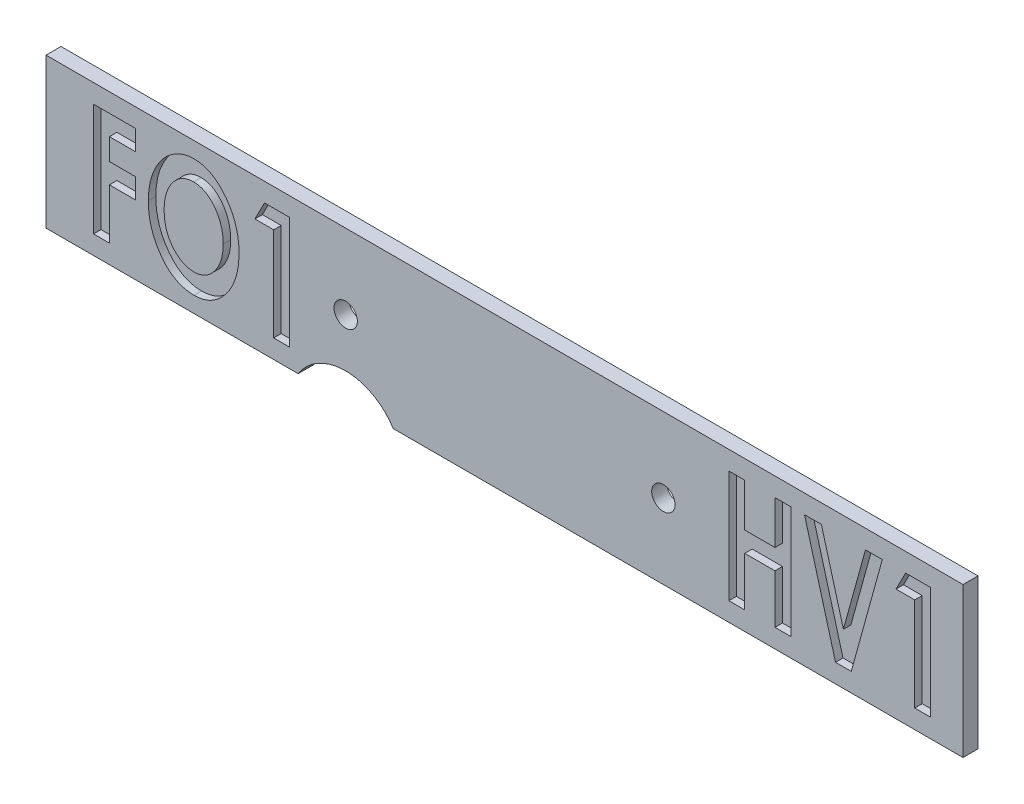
ISO-10303-21;
HEADER;
FILE_DESCRIPTION(('STEP AP214'),'2;1');
FILE_NAME('part.step','',(''),(''),'','','');
FILE_SCHEMA(('AUTOMOTIVE_DESIGN { 1 0 10303 214 1 1 1 1 }'));
ENDSEC;
DATA;
#1=APPLICATION_CONTEXT('core data for automotive mechanical design processes');
#2=APPLICATION_PROTOCOL_DEFINITION('international standard','automotive_design',2000,#1);
#3=PRODUCT_CONTEXT('',#1,'mechanical');
#4=PRODUCT('Part','Part','',(#3));
#5=PRODUCT_RELATED_PRODUCT_CATEGORY('part','',(#4));
#6=PRODUCT_DEFINITION_FORMATION('','',#4);
#7=PRODUCT_DEFINITION_CONTEXT('part definition',#1,'design');
#8=PRODUCT_DEFINITION('design','',#6,#7);
#9=PRODUCT_DEFINITION_SHAPE('','',#8);
#10=(LENGTH_UNIT() NAMED_UNIT(*) SI_UNIT(.MILLI.,.METRE.));
#11=(NAMED_UNIT(*) PLANE_ANGLE_UNIT() SI_UNIT($,.RADIAN.));
#12=(NAMED_UNIT(*) SI_UNIT($,.STERADIAN.) SOLID_ANGLE_UNIT());
#13=UNCERTAINTY_MEASURE_WITH_UNIT(LENGTH_MEASURE(1.E-05),#10,'distance_accuracy_value','');
#14=(GEOMETRIC_REPRESENTATION_CONTEXT(3) GLOBAL_UNCERTAINTY_ASSIGNED_CONTEXT((#13)) GLOBAL_UNIT_ASSIGNED_CONTEXT((#10,
#11,#12)) REPRESENTATION_CONTEXT('',''));
#15=CARTESIAN_POINT('',(0.,0.,0.));
#16=DIRECTION('',(0.,0.,1.));
#17=DIRECTION('',(1.,0.,0.));
#18=AXIS2_PLACEMENT_3D('',#15,#16,#17);
#19=CARTESIAN_POINT('',(0.,0.,2.54));
#20=DIRECTION('',(0.,1.,0.));
#21=DIRECTION('',(-1.,0.,0.));
#22=AXIS2_PLACEMENT_3D('',#19,#20,#21);
#23=PLANE('',#22);
#24=DIRECTION('',(1.,0.,0.));
#25=VECTOR('',#24,1.);
#26=CARTESIAN_POINT('',(0.,0.,0.));
#27=LINE('',#26,#25);
#28=CARTESIAN_POINT('',(-155.448,0.,0.));
#29=VERTEX_POINT('',#28);
#30=CARTESIAN_POINT('',(-112.705246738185,0.,0.));
#31=VERTEX_POINT('',#30);
#32=EDGE_CURVE('E401',#29,#31,#27,.T.);
#33=ORIENTED_EDGE('',*,*,#32,.T.);
#34=DIRECTION('',(0.,0.,1.));
#35=VECTOR('',#34,1.);
#36=CARTESIAN_POINT('',(-112.705246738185,0.,0.));
#37=LINE('',#36,#35);
#38=CARTESIAN_POINT('',(-112.705246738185,0.,2.54));
#39=VERTEX_POINT('',#38);
#40=EDGE_CURVE('E41',#31,#39,#37,.T.);
#41=ORIENTED_EDGE('',*,*,#40,.T.);
#42=DIRECTION('',(1.,0.,0.));
#43=VECTOR('',#42,1.);
#44=CARTESIAN_POINT('',(0.,0.,2.54));
#45=LINE('',#44,#43);
#46=CARTESIAN_POINT('',(-155.448,0.,2.54));
#47=VERTEX_POINT('',#46);
#48=EDGE_CURVE('E415',#47,#39,#45,.T.);
#49=ORIENTED_EDGE('',*,*,#48,.F.);
#50=DIRECTION('',(0.,0.,-1.));
#51=VECTOR('',#50,1.);
#52=CARTESIAN_POINT('',(-155.448,0.,2.54));
#53=LINE('',#52,#51);
#54=EDGE_CURVE('E420',#47,#29,#53,.T.);
#55=ORIENTED_EDGE('',*,*,#54,.T.);
#56=EDGE_LOOP('',(#33,#41,#49,#55));
#57=FACE_BOUND('',#56,.T.);
#58=ADVANCED_FACE('F26',(#57),#23,.F.);
#59=CARTESIAN_POINT('',(0.,25.4,2.54));
#60=DIRECTION('',(0.,0.,1.));
#61=DIRECTION('',(1.,0.,0.));
#62=AXIS2_PLACEMENT_3D('',#59,#60,#61);
#63=PLANE('',#62);
#64=CARTESIAN_POINT('',(-104.648,12.7,2.54));
#65=DIRECTION('',(0.,0.,1.));
#66=DIRECTION('',(1.,0.,0.));
#67=AXIS2_PLACEMENT_3D('',#64,#65,#66);
#68=CIRCLE('',#67,1.9812);
#69=CARTESIAN_POINT('',(-102.6668,12.7,2.54));
#70=VERTEX_POINT('',#69);
#71=EDGE_CURVE('E1366',#70,#70,#68,.T.);
#72=ORIENTED_EDGE('',*,*,#71,.F.);
#73=EDGE_LOOP('',(#72));
#74=FACE_BOUND('',#73,.T.);
#75=CARTESIAN_POINT('',(-50.8,12.7,2.54));
#76=DIRECTION('',(0.,0.,1.));
#77=DIRECTION('',(1.,0.,0.));
#78=AXIS2_PLACEMENT_3D('',#75,#76,#77);
#79=CIRCLE('',#78,1.9812);
#80=CARTESIAN_POINT('',(-48.8188,12.7,2.54));
#81=VERTEX_POINT('',#80);
#82=EDGE_CURVE('E1360',#81,#81,#79,.T.);
#83=ORIENTED_EDGE('',*,*,#82,.F.);
#84=EDGE_LOOP('',(#83));
#85=FACE_BOUND('',#84,.T.);
#86=CARTESIAN_POINT('',(-104.648,-5.08000000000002,2.54));
#87=DIRECTION('',(0.,0.,1.));
#88=DIRECTION('',(1.,0.,0.));
#89=AXIS2_PLACEMENT_3D('',#86,#87,#88);
#90=CIRCLE('',#89,9.52500000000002);
#91=CARTESIAN_POINT('',(-96.5907532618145,0.,2.54));
#92=VERTEX_POINT('',#91);
#93=EDGE_CURVE('E387',#92,#39,#90,.T.);
#94=ORIENTED_EDGE('',*,*,#93,.F.);
#95=CARTESIAN_POINT('',(0.,0.,2.54));
#96=VERTEX_POINT('',#95);
#97=EDGE_CURVE('E395',#92,#96,#45,.T.);
#98=ORIENTED_EDGE('',*,*,#97,.T.);
#99=DIRECTION('',(0.,1.,0.));
#100=VECTOR('',#99,1.);
#101=CARTESIAN_POINT('',(0.,0.,2.54));
#102=LINE('',#101,#100);
#103=CARTESIAN_POINT('',(0.,25.4,2.54));
#104=VERTEX_POINT('',#103);
#105=EDGE_CURVE('E404',#96,#104,#102,.T.);
#106=ORIENTED_EDGE('',*,*,#105,.T.);
#107=DIRECTION('',(-1.,0.,0.));
#108=VECTOR('',#107,1.);
#109=CARTESIAN_POINT('',(0.,25.4,2.54));
#110=LINE('',#109,#108);
#111=CARTESIAN_POINT('',(-155.448,25.4,2.54));
#112=VERTEX_POINT('',#111);
#113=EDGE_CURVE('E411',#104,#112,#110,.T.);
#114=ORIENTED_EDGE('',*,*,#113,.T.);
#115=DIRECTION('',(0.,-1.,0.));
#116=VECTOR('',#115,1.);
#117=CARTESIAN_POINT('',(-155.448,0.,2.54));
#118=LINE('',#117,#116);
#119=EDGE_CURVE('E413',#112,#47,#118,.T.);
#120=ORIENTED_EDGE('',*,*,#119,.T.);
#121=ORIENTED_EDGE('',*,*,#48,.T.);
#122=EDGE_LOOP('',(#94,#98,#106,#114,#120,#121));
#123=FACE_BOUND('',#122,.T.);
#124=DIRECTION('',(-1.,0.,0.));
#125=VECTOR('',#124,1.);
#126=CARTESIAN_POINT('',(-18.9480336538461,3.17499999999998,2.53999999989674));
#127=LINE('',#126,#125);
#128=CARTESIAN_POINT('',(-18.9480336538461,3.17499999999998,2.53999999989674));
#129=VERTEX_POINT('',#128);
#130=CARTESIAN_POINT('',(-21.6154915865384,3.17499999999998,2.54));
#131=VERTEX_POINT('',#130);
#132=EDGE_CURVE('E1176',#129,#131,#127,.T.);
#133=ORIENTED_EDGE('',*,*,#132,.T.);
#134=DIRECTION('',(-0.265910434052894,0.963997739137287,0.));
#135=VECTOR('',#134,1.);
#136=CARTESIAN_POINT('',(-21.6154915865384,3.17499999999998,2.53999999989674));
#137=LINE('',#136,#135);
#138=CARTESIAN_POINT('',(-26.8702692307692,22.225,2.53999999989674));
#139=VERTEX_POINT('',#138);
#140=EDGE_CURVE('E1158',#131,#139,#137,.T.);
#141=ORIENTED_EDGE('',*,*,#140,.T.);
#142=DIRECTION('',(1.,0.,0.));
#143=VECTOR('',#142,1.);
#144=CARTESIAN_POINT('',(-26.8702692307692,22.225,2.53999999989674));
#145=LINE('',#144,#143);
#146=CARTESIAN_POINT('',(-24.0081899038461,22.225,2.53999999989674));
#147=VERTEX_POINT('',#146);
#148=EDGE_CURVE('E1161',#139,#147,#145,.T.);
#149=ORIENTED_EDGE('',*,*,#148,.T.);
#150=DIRECTION('',(0.265876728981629,-0.96400703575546,0.));
#151=VECTOR('',#150,1.);
#152=CARTESIAN_POINT('',(-24.0081899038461,22.225,2.53999999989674));
#153=LINE('',#152,#151);
#154=CARTESIAN_POINT('',(-20.2760384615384,8.69308894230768,2.53999999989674));
#155=VERTEX_POINT('',#154);
#156=EDGE_CURVE('E1164',#147,#155,#153,.T.);
#157=ORIENTED_EDGE('',*,*,#156,.T.);
#158=DIRECTION('',(0.266381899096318,0.963867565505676,0.));
#159=VECTOR('',#158,1.);
#160=CARTESIAN_POINT('',(-20.2760384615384,8.69308894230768,2.53999999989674));
#161=LINE('',#160,#159);
#162=CARTESIAN_POINT('',(-16.5362548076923,22.225,2.53999999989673));
#163=VERTEX_POINT('',#162);
#164=EDGE_CURVE('E1167',#155,#163,#161,.T.);
#165=ORIENTED_EDGE('',*,*,#164,.T.);
#166=DIRECTION('',(1.,0.,0.));
#167=VECTOR('',#166,1.);
#168=CARTESIAN_POINT('',(-16.5362548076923,22.225,2.53999999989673));
#169=LINE('',#168,#167);
#170=CARTESIAN_POINT('',(-13.6818076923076,22.225,2.53999999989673));
#171=VERTEX_POINT('',#170);
#172=EDGE_CURVE('E1170',#163,#171,#169,.T.);
#173=ORIENTED_EDGE('',*,*,#172,.T.);
#174=DIRECTION('',(-0.266448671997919,-0.963849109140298,0.));
#175=VECTOR('',#174,1.);
#176=CARTESIAN_POINT('',(-13.6818076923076,22.225,2.53999999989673));
#177=LINE('',#176,#175);
#178=EDGE_CURVE('E1173',#171,#129,#177,.T.);
#179=ORIENTED_EDGE('',*,*,#178,.T.);
#180=EDGE_LOOP('',(#133,#141,#149,#157,#165,#173,#179));
#181=FACE_BOUND('',#180,.T.);
#182=DIRECTION('',(-1.,0.,0.));
#183=VECTOR('',#182,1.);
#184=CARTESIAN_POINT('',(-116.859538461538,19.05,2.54));
#185=LINE('',#184,#183);
#186=CARTESIAN_POINT('',(-116.859538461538,19.05,2.54));
#187=VERTEX_POINT('',#186);
#188=CARTESIAN_POINT('',(-120.034538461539,19.05,2.54));
#189=VERTEX_POINT('',#188);
#190=EDGE_CURVE('E1024',#187,#189,#185,.T.);
#191=ORIENTED_EDGE('',*,*,#190,.T.);
#192=DIRECTION('',(0.457444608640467,0.889238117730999,0.));
#193=VECTOR('',#192,1.);
#194=CARTESIAN_POINT('',(-120.034538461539,19.05,2.54));
#195=LINE('',#194,#193);
#196=CARTESIAN_POINT('',(-118.401245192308,22.225,2.54));
#197=VERTEX_POINT('',#196);
#198=EDGE_CURVE('E1011',#189,#197,#195,.T.);
#199=ORIENTED_EDGE('',*,*,#198,.T.);
#200=DIRECTION('',(1.,0.,0.));
#201=VECTOR('',#200,1.);
#202=CARTESIAN_POINT('',(-118.401245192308,22.225,2.54));
#203=LINE('',#202,#201);
#204=CARTESIAN_POINT('',(-114.173,22.225,2.54));
#205=VERTEX_POINT('',#204);
#206=EDGE_CURVE('E1001',#197,#205,#203,.T.);
#207=ORIENTED_EDGE('',*,*,#206,.T.);
#208=DIRECTION('',(0.,-1.,0.));
#209=VECTOR('',#208,1.);
#210=CARTESIAN_POINT('',(-114.173,22.225,2.54));
#211=LINE('',#210,#209);
#212=CARTESIAN_POINT('',(-114.173,3.17499999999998,2.54));
#213=VERTEX_POINT('',#212);
#214=EDGE_CURVE('E1010',#205,#213,#211,.T.);
#215=ORIENTED_EDGE('',*,*,#214,.T.);
#216=DIRECTION('',(-1.,0.,0.));
#217=VECTOR('',#216,1.);
#218=CARTESIAN_POINT('',(-114.173,3.17499999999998,2.54));
#219=LINE('',#218,#217);
#220=CARTESIAN_POINT('',(-116.859538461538,3.17499999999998,2.54));
#221=VERTEX_POINT('',#220);
#222=EDGE_CURVE('E1033',#213,#221,#219,.T.);
#223=ORIENTED_EDGE('',*,*,#222,.T.);
#224=DIRECTION('',(0.,1.,0.));
#225=VECTOR('',#224,1.);
#226=CARTESIAN_POINT('',(-116.859538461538,3.17499999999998,2.54));
#227=LINE('',#226,#225);
#228=EDGE_CURVE('E1036',#221,#187,#227,.T.);
#229=ORIENTED_EDGE('',*,*,#228,.T.);
#230=EDGE_LOOP('',(#191,#199,#207,#215,#223,#229));
#231=FACE_BOUND('',#230,.T.);
#232=DIRECTION('',(-1.,0.,0.));
#233=VECTOR('',#232,1.);
#234=CARTESIAN_POINT('',(-144.701846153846,3.17499999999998,2.54));
#235=LINE('',#234,#233);
#236=CARTESIAN_POINT('',(-144.701846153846,3.17499999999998,2.54));
#237=VERTEX_POINT('',#236);
#238=CARTESIAN_POINT('',(-147.388384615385,3.17499999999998,2.54));
#239=VERTEX_POINT('',#238);
#240=EDGE_CURVE('E484',#237,#239,#235,.T.);
#241=ORIENTED_EDGE('',*,*,#240,.T.);
#242=DIRECTION('',(0.,1.,0.));
#243=VECTOR('',#242,1.);
#244=CARTESIAN_POINT('',(-147.388384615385,3.17499999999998,2.54));
#245=LINE('',#244,#243);
#246=CARTESIAN_POINT('',(-147.388384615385,22.225,2.54));
#247=VERTEX_POINT('',#246);
#248=EDGE_CURVE('E511',#239,#247,#245,.T.);
#249=ORIENTED_EDGE('',*,*,#248,.T.);
#250=DIRECTION('',(1.,0.,0.));
#251=VECTOR('',#250,1.);
#252=CARTESIAN_POINT('',(-147.388384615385,22.225,2.54));
#253=LINE('',#252,#251);
#254=CARTESIAN_POINT('',(-140.305692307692,22.225,2.53999999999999));
#255=VERTEX_POINT('',#254);
#256=EDGE_CURVE('E508',#247,#255,#253,.T.);
#257=ORIENTED_EDGE('',*,*,#256,.T.);
#258=DIRECTION('',(0.,-1.,0.));
#259=VECTOR('',#258,1.);
#260=CARTESIAN_POINT('',(-140.305692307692,22.225,2.53999999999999));
#261=LINE('',#260,#259);
#262=CARTESIAN_POINT('',(-140.305692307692,18.8057692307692,2.54));
#263=VERTEX_POINT('',#262);
#264=EDGE_CURVE('E505',#255,#263,#261,.T.);
#265=ORIENTED_EDGE('',*,*,#264,.T.);
#266=DIRECTION('',(-1.,0.,0.));
#267=VECTOR('',#266,1.);
#268=CARTESIAN_POINT('',(-140.305692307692,18.8057692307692,2.54));
#269=LINE('',#268,#267);
#270=CARTESIAN_POINT('',(-144.701846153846,18.8057692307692,2.54));
#271=VERTEX_POINT('',#270);
#272=EDGE_CURVE('E502',#263,#271,#269,.T.);
#273=ORIENTED_EDGE('',*,*,#272,.T.);
#274=DIRECTION('',(0.,-1.,0.));
#275=VECTOR('',#274,1.);
#276=CARTESIAN_POINT('',(-144.701846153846,18.8057692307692,2.54));
#277=LINE('',#276,#275);
#278=CARTESIAN_POINT('',(-144.701846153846,15.1423076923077,2.54));
#279=VERTEX_POINT('',#278);
#280=EDGE_CURVE('E499',#271,#279,#277,.T.);
#281=ORIENTED_EDGE('',*,*,#280,.T.);
#282=DIRECTION('',(1.,0.,0.));
#283=VECTOR('',#282,1.);
#284=CARTESIAN_POINT('',(-144.701846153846,15.1423076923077,2.54));
#285=LINE('',#284,#283);
#286=CARTESIAN_POINT('',(-140.305692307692,15.1423076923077,2.54));
#287=VERTEX_POINT('',#286);
#288=EDGE_CURVE('E496',#279,#287,#285,.T.);
#289=ORIENTED_EDGE('',*,*,#288,.T.);
#290=DIRECTION('',(0.,-1.,0.));
#291=VECTOR('',#290,1.);
#292=CARTESIAN_POINT('',(-140.305692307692,15.1423076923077,2.54));
#293=LINE('',#292,#291);
#294=CARTESIAN_POINT('',(-140.305692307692,11.7230769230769,2.54));
#295=VERTEX_POINT('',#294);
#296=EDGE_CURVE('E493',#287,#295,#293,.T.);
#297=ORIENTED_EDGE('',*,*,#296,.T.);
#298=DIRECTION('',(-1.,0.,0.));
#299=VECTOR('',#298,1.);
#300=CARTESIAN_POINT('',(-140.305692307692,11.7230769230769,2.54));
#301=LINE('',#300,#299);
#302=CARTESIAN_POINT('',(-144.701846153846,11.7230769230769,2.54));
#303=VERTEX_POINT('',#302);
#304=EDGE_CURVE('E490',#295,#303,#301,.T.);
#305=ORIENTED_EDGE('',*,*,#304,.T.);
#306=DIRECTION('',(0.,-1.,0.));
#307=VECTOR('',#306,1.);
#308=CARTESIAN_POINT('',(-144.701846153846,11.7230769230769,2.54));
#309=LINE('',#308,#307);
#310=EDGE_CURVE('E487',#303,#237,#309,.T.);
#311=ORIENTED_EDGE('',*,*,#310,.T.);
#312=EDGE_LOOP('',(#241,#249,#257,#265,#273,#281,#289,#297,#305,#311));
#313=FACE_BOUND('',#312,.T.);
#314=CARTESIAN_POINT('',(-130.364736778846,2.68653846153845,2.54));
#315=CARTESIAN_POINT('',(-130.637660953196,2.69447546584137,2.54));
#316=CARTESIAN_POINT('',(-131.174585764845,2.71008996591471,2.54));
#317=CARTESIAN_POINT('',(-131.959092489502,2.85950186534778,2.54));
#318=CARTESIAN_POINT('',(-132.711924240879,3.08472561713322,2.54));
#319=CARTESIAN_POINT('',(-133.424100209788,3.41980803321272,2.54));
#320=CARTESIAN_POINT('',(-134.106329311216,3.83776521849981,2.54));
#321=CARTESIAN_POINT('',(-134.749024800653,4.35371118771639,2.54));
#322=CARTESIAN_POINT('',(-135.353962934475,4.96250810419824,2.54));
#323=CARTESIAN_POINT('',(-135.91707938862,5.65264113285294,2.54));
#324=CARTESIAN_POINT('',(-136.425609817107,6.40754345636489,2.54));
#325=CARTESIAN_POINT('',(-136.880627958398,7.20223380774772,2.54));
#326=CARTESIAN_POINT('',(-137.256821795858,8.03682050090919,2.54));
#327=CARTESIAN_POINT('',(-137.567363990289,8.90473111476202,2.54));
#328=CARTESIAN_POINT('',(-137.812778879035,9.80507663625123,2.54));
#329=CARTESIAN_POINT('',(-137.982808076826,10.7422335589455,2.54));
#330=CARTESIAN_POINT('',(-138.088654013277,11.7129977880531,2.54));
#331=CARTESIAN_POINT('',(-138.101232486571,12.3728120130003,2.54));
#332=CARTESIAN_POINT('',(-138.107615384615,12.7076322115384,2.54));
#333=B_SPLINE_CURVE_WITH_KNOTS('',3,(#314,#315,#316,#317,#318,#319,#320,#321,#322,#323,#324,
#325,#326,#327,#328,#329,#330,#331,#332),.UNSPECIFIED.,.F.,.F.,(4,1,1,1,1,1,1,1,1,1,1,1,1,1,1,1,
4),(0.,0.0582060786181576,0.114509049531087,0.169914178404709,0.22556301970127,
0.282013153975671,0.340371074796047,0.401050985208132,0.464926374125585,0.530229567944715,
0.595171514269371,0.660191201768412,0.725387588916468,0.791791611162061,0.859170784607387,
0.928536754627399,1.),.UNSPECIFIED.);
#334=CARTESIAN_POINT('',(-130.364736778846,2.68653846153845,2.54));
#335=VERTEX_POINT('',#334);
#336=CARTESIAN_POINT('',(-138.107615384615,12.7076322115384,2.54));
#337=VERTEX_POINT('',#336);
#338=EDGE_CURVE('E569',#335,#337,#333,.T.);
#339=ORIENTED_EDGE('',*,*,#338,.T.);
#340=CARTESIAN_POINT('',(-138.107615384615,12.7076322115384,2.54));
#341=CARTESIAN_POINT('',(-138.105059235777,12.9328800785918,2.54));
#342=CARTESIAN_POINT('',(-138.099983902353,13.3801185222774,2.54));
#343=CARTESIAN_POINT('',(-138.047897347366,14.0435681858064,2.54));
#344=CARTESIAN_POINT('',(-137.968403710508,14.6930703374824,2.54));
#345=CARTESIAN_POINT('',(-137.858462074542,15.329150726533,2.54));
#346=CARTESIAN_POINT('',(-137.712538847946,15.9503556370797,2.54));
#347=CARTESIAN_POINT('',(-137.537460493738,16.5598642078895,2.54));
#348=CARTESIAN_POINT('',(-137.32723548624,17.1544516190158,2.54));
#349=CARTESIAN_POINT('',(-137.086262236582,17.7332928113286,2.54));
#350=CARTESIAN_POINT('',(-136.823446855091,18.2924675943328,2.54));
#351=CARTESIAN_POINT('',(-136.526011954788,18.820172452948,2.54));
#352=CARTESIAN_POINT('',(-136.211416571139,19.3222890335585,2.54));
#353=CARTESIAN_POINT('',(-135.866416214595,19.7901742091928,2.54));
#354=CARTESIAN_POINT('',(-135.502769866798,20.232812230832,2.54));
#355=CARTESIAN_POINT('',(-135.114902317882,20.6444642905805,2.54));
#356=CARTESIAN_POINT('',(-134.699342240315,21.0245430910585,2.54));
#357=CARTESIAN_POINT('',(-134.262762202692,21.3729474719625,2.54));
#358=CARTESIAN_POINT('',(-133.812402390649,21.6902292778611,2.54));
#359=CARTESIAN_POINT('',(-133.346431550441,21.9617144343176,2.54));
#360=CARTESIAN_POINT('',(-132.875892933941,22.1959618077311,2.54));
#361=CARTESIAN_POINT('',(-132.393563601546,22.38284082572,2.54));
#362=CARTESIAN_POINT('',(-131.904918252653,22.5353844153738,2.54));
#363=CARTESIAN_POINT('',(-131.404389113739,22.6339982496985,2.54));
#364=CARTESIAN_POINT('',(-130.897203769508,22.7050244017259,2.54));
#365=CARTESIAN_POINT('',(-130.555795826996,22.7106351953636,2.54));
#366=CARTESIAN_POINT('',(-130.383817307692,22.7134615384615,2.54));
#367=B_SPLINE_CURVE_WITH_KNOTS('',3,(#340,#341,#342,#343,#344,#345,#346,#347,#348,#349,#350,
#351,#352,#353,#354,#355,#356,#357,#358,#359,#360,#361,#362,#363,#364,#365,#366),.UNSPECIFIED.,
.F.,.F.,(4,1,1,1,1,1,1,1,1,1,1,1,1,1,1,1,1,1,1,1,1,1,1,1,4),(0.,0.0482729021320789,
0.0958477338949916,0.142552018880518,0.188498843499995,0.234133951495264,0.279264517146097,
0.324365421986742,0.369228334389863,0.413621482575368,0.456709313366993,0.498993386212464,
0.540549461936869,0.581220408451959,0.621724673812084,0.661671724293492,0.7018266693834,
0.741385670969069,0.779637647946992,0.81731686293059,0.853924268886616,0.890408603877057,
0.926877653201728,0.963165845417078,1.),.UNSPECIFIED.);
#368=CARTESIAN_POINT('',(-130.383817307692,22.7134615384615,2.54));
#369=VERTEX_POINT('',#368);
#370=EDGE_CURVE('E593',#337,#369,#367,.T.);
#371=ORIENTED_EDGE('',*,*,#370,.T.);
#372=CARTESIAN_POINT('',(-130.383817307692,22.7134615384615,2.54));
#373=CARTESIAN_POINT('',(-130.126230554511,22.7049013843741,2.54));
#374=CARTESIAN_POINT('',(-129.616226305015,22.6879528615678,2.54));
#375=CARTESIAN_POINT('',(-128.866174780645,22.5449761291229,2.54));
#376=CARTESIAN_POINT('',(-128.143773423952,22.3164276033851,2.54));
#377=CARTESIAN_POINT('',(-127.450432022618,21.9900699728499,2.53999999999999));
#378=CARTESIAN_POINT('',(-126.783868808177,21.5761193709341,2.54));
#379=CARTESIAN_POINT('',(-126.147393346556,21.0677213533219,2.54));
#380=CARTESIAN_POINT('',(-125.543022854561,20.4654215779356,2.54));
#381=CARTESIAN_POINT('',(-124.969665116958,19.7849925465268,2.54));
#382=CARTESIAN_POINT('',(-124.442050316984,19.0397527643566,2.54));
#383=CARTESIAN_POINT('',(-123.983909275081,18.2424465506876,2.54));
#384=CARTESIAN_POINT('',(-123.593367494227,17.4075562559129,2.54));
#385=CARTESIAN_POINT('',(-123.270840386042,16.5337343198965,2.54));
#386=CARTESIAN_POINT('',(-123.022502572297,15.6179926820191,2.54));
#387=CARTESIAN_POINT('',(-122.850045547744,14.6615812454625,2.54));
#388=CARTESIAN_POINT('',(-122.738706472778,13.6655639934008,2.54));
#389=CARTESIAN_POINT('',(-122.727023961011,12.9877850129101,2.54));
#390=CARTESIAN_POINT('',(-122.721076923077,12.6427584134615,2.54));
#391=B_SPLINE_CURVE_WITH_KNOTS('',3,(#372,#373,#374,#375,#376,#377,#378,#379,#380,#381,#382,
#383,#384,#385,#386,#387,#388,#389,#390),.UNSPECIFIED.,.F.,.F.,(4,1,1,1,1,1,1,1,1,1,1,1,1,1,1,1,
4),(0.,0.0551294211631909,0.109152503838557,0.162915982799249,0.217031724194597,
0.272824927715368,0.330604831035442,0.391095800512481,0.455280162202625,0.520965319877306,
0.586386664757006,0.65195759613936,0.718154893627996,0.785632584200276,0.854885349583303,
0.926128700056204,1.),.UNSPECIFIED.);
#392=CARTESIAN_POINT('',(-122.721076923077,12.6427584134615,2.54));
#393=VERTEX_POINT('',#392);
#394=EDGE_CURVE('E585',#369,#393,#391,.T.);
#395=ORIENTED_EDGE('',*,*,#394,.T.);
#396=CARTESIAN_POINT('',(-122.721076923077,12.6427584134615,2.54));
#397=CARTESIAN_POINT('',(-122.726993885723,12.3015373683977,2.54));
#398=CARTESIAN_POINT('',(-122.738637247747,11.6300847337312,2.54));
#399=CARTESIAN_POINT('',(-122.850649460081,10.6445626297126,2.54));
#400=CARTESIAN_POINT('',(-123.019060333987,9.69698872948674,2.54));
#401=CARTESIAN_POINT('',(-123.262838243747,8.78981612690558,2.54));
#402=CARTESIAN_POINT('',(-123.58310229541,7.92495758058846,2.54));
#403=CARTESIAN_POINT('',(-123.962620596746,7.09596510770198,2.54));
#404=CARTESIAN_POINT('',(-124.42118021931,6.31139683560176,2.54));
#405=CARTESIAN_POINT('',(-124.937719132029,5.5733455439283,2.54));
#406=CARTESIAN_POINT('',(-125.506232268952,4.90140187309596,2.54));
#407=CARTESIAN_POINT('',(-126.109023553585,4.3101001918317,2.54));
#408=CARTESIAN_POINT('',(-126.743119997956,3.8090311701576,2.54));
#409=CARTESIAN_POINT('',(-127.406935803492,3.39509411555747,2.54));
#410=CARTESIAN_POINT('',(-128.105236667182,3.07709142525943,2.54));
#411=CARTESIAN_POINT('',(-128.831980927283,2.85065643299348,2.54));
#412=CARTESIAN_POINT('',(-129.588649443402,2.71264176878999,2.54));
#413=CARTESIAN_POINT('',(-130.103389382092,2.6953287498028,2.54));
#414=CARTESIAN_POINT('',(-130.364736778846,2.68653846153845,2.54));
#415=B_SPLINE_CURVE_WITH_KNOTS('',3,(#396,#397,#398,#399,#400,#401,#402,#403,#404,#405,#406,
#407,#408,#409,#410,#411,#412,#413,#414),.UNSPECIFIED.,.F.,.F.,(4,1,1,1,1,1,1,1,1,1,1,1,1,1,1,1,
4),(0.,0.0735273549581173,0.144686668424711,0.213529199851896,0.280842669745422,
0.346859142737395,0.412125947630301,0.477121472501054,0.542467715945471,0.606085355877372,
0.666583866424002,0.724182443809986,0.779959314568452,0.834808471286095,0.88909892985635,
0.943692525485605,1.),.UNSPECIFIED.);
#416=EDGE_CURVE('E577',#393,#335,#415,.T.);
#417=ORIENTED_EDGE('',*,*,#416,.T.);
#418=EDGE_LOOP('',(#339,#371,#395,#417));
#419=FACE_BOUND('',#418,.T.);
#420=DIRECTION('',(-1.,0.,0.));
#421=VECTOR('',#420,1.);
#422=CARTESIAN_POINT('',(-37.0058461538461,3.17499999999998,2.53999999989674));
#423=LINE('',#422,#421);
#424=CARTESIAN_POINT('',(-37.0058461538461,3.17499999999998,2.53999999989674));
#425=VERTEX_POINT('',#424);
#426=CARTESIAN_POINT('',(-39.6923846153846,3.17499999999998,2.54));
#427=VERTEX_POINT('',#426);
#428=EDGE_CURVE('E1118',#425,#427,#423,.T.);
#429=ORIENTED_EDGE('',*,*,#428,.T.);
#430=DIRECTION('',(0.,1.,0.));
#431=VECTOR('',#430,1.);
#432=CARTESIAN_POINT('',(-39.6923846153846,3.17499999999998,2.53999999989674));
#433=LINE('',#432,#431);
#434=CARTESIAN_POINT('',(-39.6923846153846,22.225,2.53999999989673));
#435=VERTEX_POINT('',#434);
#436=EDGE_CURVE('E1210',#427,#435,#433,.T.);
#437=ORIENTED_EDGE('',*,*,#436,.T.);
#438=DIRECTION('',(1.,0.,0.));
#439=VECTOR('',#438,1.);
#440=CARTESIAN_POINT('',(-39.6923846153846,22.225,2.53999999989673));
#441=LINE('',#440,#439);
#442=CARTESIAN_POINT('',(-37.0058461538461,22.225,2.53999999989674));
#443=VERTEX_POINT('',#442);
#444=EDGE_CURVE('E1212',#435,#443,#441,.T.);
#445=ORIENTED_EDGE('',*,*,#444,.T.);
#446=DIRECTION('',(0.,-1.,0.));
#447=VECTOR('',#446,1.);
#448=CARTESIAN_POINT('',(-37.0058461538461,22.225,2.53999999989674));
#449=LINE('',#448,#447);
#450=CARTESIAN_POINT('',(-37.0058461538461,14.8980769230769,2.53999999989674));
#451=VERTEX_POINT('',#450);
#452=EDGE_CURVE('E1215',#443,#451,#449,.T.);
#453=ORIENTED_EDGE('',*,*,#452,.T.);
#454=DIRECTION('',(1.,0.,0.));
#455=VECTOR('',#454,1.);
#456=CARTESIAN_POINT('',(-37.0058461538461,14.8980769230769,2.53999999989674));
#457=LINE('',#456,#455);
#458=CARTESIAN_POINT('',(-31.8769999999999,14.8980769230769,2.53999999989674));
#459=VERTEX_POINT('',#458);
#460=EDGE_CURVE('E1218',#451,#459,#457,.T.);
#461=ORIENTED_EDGE('',*,*,#460,.T.);
#462=DIRECTION('',(0.,1.,0.));
#463=VECTOR('',#462,1.);
#464=CARTESIAN_POINT('',(-31.8769999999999,14.8980769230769,2.53999999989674));
#465=LINE('',#464,#463);
#466=CARTESIAN_POINT('',(-31.8769999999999,22.225,2.53999999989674));
#467=VERTEX_POINT('',#466);
#468=EDGE_CURVE('E1221',#459,#467,#465,.T.);
#469=ORIENTED_EDGE('',*,*,#468,.T.);
#470=DIRECTION('',(1.,0.,0.));
#471=VECTOR('',#470,1.);
#472=CARTESIAN_POINT('',(-31.8769999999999,22.225,2.53999999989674));
#473=LINE('',#472,#471);
#474=CARTESIAN_POINT('',(-29.1904615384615,22.225,2.53999999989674));
#475=VERTEX_POINT('',#474);
#476=EDGE_CURVE('E1224',#467,#475,#473,.T.);
#477=ORIENTED_EDGE('',*,*,#476,.T.);
#478=DIRECTION('',(0.,-1.,0.));
#479=VECTOR('',#478,1.);
#480=CARTESIAN_POINT('',(-29.1904615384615,22.225,2.53999999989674));
#481=LINE('',#480,#479);
#482=CARTESIAN_POINT('',(-29.1904615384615,3.17499999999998,2.53999999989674));
#483=VERTEX_POINT('',#482);
#484=EDGE_CURVE('E1227',#475,#483,#481,.T.);
#485=ORIENTED_EDGE('',*,*,#484,.T.);
#486=DIRECTION('',(-1.,0.,0.));
#487=VECTOR('',#486,1.);
#488=CARTESIAN_POINT('',(-29.1904615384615,3.17499999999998,2.53999999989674));
#489=LINE('',#488,#487);
#490=CARTESIAN_POINT('',(-31.8769999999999,3.17499999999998,2.53999999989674));
#491=VERTEX_POINT('',#490);
#492=EDGE_CURVE('E1230',#483,#491,#489,.T.);
#493=ORIENTED_EDGE('',*,*,#492,.T.);
#494=DIRECTION('',(0.,1.,0.));
#495=VECTOR('',#494,1.);
#496=CARTESIAN_POINT('',(-31.8769999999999,3.17499999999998,2.53999999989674));
#497=LINE('',#496,#495);
#498=CARTESIAN_POINT('',(-31.8769999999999,11.4788461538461,2.53999999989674));
#499=VERTEX_POINT('',#498);
#500=EDGE_CURVE('E1233',#491,#499,#497,.T.);
#501=ORIENTED_EDGE('',*,*,#500,.T.);
#502=DIRECTION('',(-1.,0.,0.));
#503=VECTOR('',#502,1.);
#504=CARTESIAN_POINT('',(-31.8769999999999,11.4788461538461,2.53999999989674));
#505=LINE('',#504,#503);
#506=CARTESIAN_POINT('',(-37.0058461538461,11.4788461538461,2.53999999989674));
#507=VERTEX_POINT('',#506);
#508=EDGE_CURVE('E1236',#499,#507,#505,.T.);
#509=ORIENTED_EDGE('',*,*,#508,.T.);
#510=DIRECTION('',(0.,-1.,0.));
#511=VECTOR('',#510,1.);
#512=CARTESIAN_POINT('',(-37.0058461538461,11.4788461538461,2.53999999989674));
#513=LINE('',#512,#511);
#514=EDGE_CURVE('E1239',#507,#425,#513,.T.);
#515=ORIENTED_EDGE('',*,*,#514,.T.);
#516=EDGE_LOOP('',(#429,#437,#445,#453,#461,#469,#477,#485,#493,#501,#509,#515));
#517=FACE_BOUND('',#516,.T.);
#518=DIRECTION('',(-1.,0.,0.));
#519=VECTOR('',#518,1.);
#520=CARTESIAN_POINT('',(-8.18661538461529,19.05,2.53999999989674));
#521=LINE('',#520,#519);
#522=CARTESIAN_POINT('',(-8.18661538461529,19.05,2.53999999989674));
#523=VERTEX_POINT('',#522);
#524=CARTESIAN_POINT('',(-11.3616153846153,19.05,2.54));
#525=VERTEX_POINT('',#524);
#526=EDGE_CURVE('E1122',#523,#525,#521,.T.);
#527=ORIENTED_EDGE('',*,*,#526,.T.);
#528=DIRECTION('',(0.45744460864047,0.889238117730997,0.));
#529=VECTOR('',#528,1.);
#530=CARTESIAN_POINT('',(-11.3616153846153,19.05,2.53999999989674));
#531=LINE('',#530,#529);
#532=CARTESIAN_POINT('',(-9.72832211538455,22.225,2.53999999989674));
#533=VERTEX_POINT('',#532);
#534=EDGE_CURVE('E49',#525,#533,#531,.T.);
#535=ORIENTED_EDGE('',*,*,#534,.T.);
#536=DIRECTION('',(1.,0.,0.));
#537=VECTOR('',#536,1.);
#538=CARTESIAN_POINT('',(-9.72832211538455,22.225,2.53999999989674));
#539=LINE('',#538,#537);
#540=CARTESIAN_POINT('',(-5.50007692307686,22.225,2.53999999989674));
#541=VERTEX_POINT('',#540);
#542=EDGE_CURVE('E1340',#533,#541,#539,.T.);
#543=ORIENTED_EDGE('',*,*,#542,.T.);
#544=DIRECTION('',(0.,-1.,0.));
#545=VECTOR('',#544,1.);
#546=CARTESIAN_POINT('',(-5.50007692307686,22.225,2.53999999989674));
#547=LINE('',#546,#545);
#548=CARTESIAN_POINT('',(-5.50007692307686,3.17499999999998,2.53999999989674));
#549=VERTEX_POINT('',#548);
#550=EDGE_CURVE('E1343',#541,#549,#547,.T.);
#551=ORIENTED_EDGE('',*,*,#550,.T.);
#552=DIRECTION('',(-1.,0.,0.));
#553=VECTOR('',#552,1.);
#554=CARTESIAN_POINT('',(-5.50007692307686,3.17499999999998,2.53999999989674));
#555=LINE('',#554,#553);
#556=CARTESIAN_POINT('',(-8.18661538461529,3.17499999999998,2.53999999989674));
#557=VERTEX_POINT('',#556);
#558=EDGE_CURVE('E1133',#549,#557,#555,.T.);
#559=ORIENTED_EDGE('',*,*,#558,.T.);
#560=DIRECTION('',(0.,1.,0.));
#561=VECTOR('',#560,1.);
#562=CARTESIAN_POINT('',(-8.18661538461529,3.17499999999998,2.53999999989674));
#563=LINE('',#562,#561);
#564=EDGE_CURVE('E1126',#557,#523,#563,.T.);
#565=ORIENTED_EDGE('',*,*,#564,.T.);
#566=EDGE_LOOP('',(#527,#535,#543,#551,#559,#565));
#567=FACE_BOUND('',#566,.T.);
#568=ADVANCED_FACE('F433',(#74,#85,#123,#181,#231,#313,#419,#517,#567),#63,.T.);
#569=CARTESIAN_POINT('',(0.,0.,2.54));
#570=DIRECTION('',(-1.,0.,0.));
#571=DIRECTION('',(0.,0.,1.));
#572=AXIS2_PLACEMENT_3D('',#569,#570,#571);
#573=PLANE('',#572);
#574=DIRECTION('',(0.,1.,0.));
#575=VECTOR('',#574,1.);
#576=CARTESIAN_POINT('',(0.,0.,0.));
#577=LINE('',#576,#575);
#578=CARTESIAN_POINT('',(0.,0.,0.));
#579=VERTEX_POINT('',#578);
#580=CARTESIAN_POINT('',(0.,25.4,0.));
#581=VERTEX_POINT('',#580);
#582=EDGE_CURVE('E400',#579,#581,#577,.T.);
#583=ORIENTED_EDGE('',*,*,#582,.T.);
#584=DIRECTION('',(0.,0.,-1.));
#585=VECTOR('',#584,1.);
#586=CARTESIAN_POINT('',(0.,25.4,2.54));
#587=LINE('',#586,#585);
#588=EDGE_CURVE('E11',#104,#581,#587,.T.);
#589=ORIENTED_EDGE('',*,*,#588,.F.);
#590=ORIENTED_EDGE('',*,*,#105,.F.);
#591=DIRECTION('',(0.,0.,-1.));
#592=VECTOR('',#591,1.);
#593=CARTESIAN_POINT('',(0.,0.,2.54));
#594=LINE('',#593,#592);
#595=EDGE_CURVE('E418',#96,#579,#594,.T.);
#596=ORIENTED_EDGE('',*,*,#595,.T.);
#597=EDGE_LOOP('',(#583,#589,#590,#596));
#598=FACE_BOUND('',#597,.T.);
#599=ADVANCED_FACE('F28',(#598),#573,.F.);
#600=CARTESIAN_POINT('',(0.,25.4,2.54));
#601=DIRECTION('',(0.,-1.,0.));
#602=DIRECTION('',(1.,0.,0.));
#603=AXIS2_PLACEMENT_3D('',#600,#601,#602);
#604=PLANE('',#603);
#605=DIRECTION('',(-1.,0.,0.));
#606=VECTOR('',#605,1.);
#607=CARTESIAN_POINT('',(0.,25.4,0.));
#608=LINE('',#607,#606);
#609=CARTESIAN_POINT('',(-155.448,25.4,0.));
#610=VERTEX_POINT('',#609);
#611=EDGE_CURVE('E405',#581,#610,#608,.T.);
#612=ORIENTED_EDGE('',*,*,#611,.T.);
#613=DIRECTION('',(0.,0.,-1.));
#614=VECTOR('',#613,1.);
#615=CARTESIAN_POINT('',(-155.448,25.4,2.54));
#616=LINE('',#615,#614);
#617=EDGE_CURVE('E34',#112,#610,#616,.T.);
#618=ORIENTED_EDGE('',*,*,#617,.F.);
#619=ORIENTED_EDGE('',*,*,#113,.F.);
#620=ORIENTED_EDGE('',*,*,#588,.T.);
#621=EDGE_LOOP('',(#612,#618,#619,#620));
#622=FACE_BOUND('',#621,.T.);
#623=ADVANCED_FACE('F437',(#622),#604,.F.);
#624=CARTESIAN_POINT('',(-155.448,0.,2.54));
#625=DIRECTION('',(1.,0.,0.));
#626=DIRECTION('',(0.,0.,-1.));
#627=AXIS2_PLACEMENT_3D('',#624,#625,#626);
#628=PLANE('',#627);
#629=DIRECTION('',(0.,-1.,0.));
#630=VECTOR('',#629,1.);
#631=CARTESIAN_POINT('',(-155.448,0.,0.));
#632=LINE('',#631,#630);
#633=EDGE_CURVE('E402',#610,#29,#632,.T.);
#634=ORIENTED_EDGE('',*,*,#633,.T.);
#635=ORIENTED_EDGE('',*,*,#54,.F.);
#636=ORIENTED_EDGE('',*,*,#119,.F.);
#637=ORIENTED_EDGE('',*,*,#617,.T.);
#638=EDGE_LOOP('',(#634,#635,#636,#637));
#639=FACE_BOUND('',#638,.T.);
#640=ADVANCED_FACE('F427',(#639),#628,.F.);
#641=ORIENTED_EDGE('',*,*,#97,.F.);
#642=DIRECTION('',(0.,0.,1.));
#643=VECTOR('',#642,1.);
#644=CARTESIAN_POINT('',(-96.5907532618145,0.,0.));
#645=LINE('',#644,#643);
#646=CARTESIAN_POINT('',(-96.5907532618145,0.,0.));
#647=VERTEX_POINT('',#646);
#648=EDGE_CURVE('E381',#92,#647,#645,.F.);
#649=ORIENTED_EDGE('',*,*,#648,.T.);
#650=EDGE_CURVE('E393',#647,#579,#27,.T.);
#651=ORIENTED_EDGE('',*,*,#650,.T.);
#652=ORIENTED_EDGE('',*,*,#595,.F.);
#653=EDGE_LOOP('',(#641,#649,#651,#652));
#654=FACE_BOUND('',#653,.T.);
#655=ADVANCED_FACE('F391',(#654),#23,.F.);
#656=CARTESIAN_POINT('',(0.,25.4,0.));
#657=DIRECTION('',(0.,0.,1.));
#658=DIRECTION('',(1.,0.,0.));
#659=AXIS2_PLACEMENT_3D('',#656,#657,#658);
#660=PLANE('',#659);
#661=CARTESIAN_POINT('',(-104.648,12.7,0.));
#662=DIRECTION('',(0.,0.,1.));
#663=DIRECTION('',(1.,0.,0.));
#664=AXIS2_PLACEMENT_3D('',#661,#662,#663);
#665=CIRCLE('',#664,1.9812);
#666=CARTESIAN_POINT('',(-102.6668,12.7,0.));
#667=VERTEX_POINT('',#666);
#668=EDGE_CURVE('E1363',#667,#667,#665,.T.);
#669=ORIENTED_EDGE('',*,*,#668,.T.);
#670=EDGE_LOOP('',(#669));
#671=FACE_BOUND('',#670,.T.);
#672=CARTESIAN_POINT('',(-50.8,12.7,0.));
#673=DIRECTION('',(0.,0.,1.));
#674=DIRECTION('',(1.,0.,0.));
#675=AXIS2_PLACEMENT_3D('',#672,#673,#674);
#676=CIRCLE('',#675,1.9812);
#677=CARTESIAN_POINT('',(-48.8188,12.7,0.));
#678=VERTEX_POINT('',#677);
#679=EDGE_CURVE('E1357',#678,#678,#676,.T.);
#680=ORIENTED_EDGE('',*,*,#679,.T.);
#681=EDGE_LOOP('',(#680));
#682=FACE_BOUND('',#681,.T.);
#683=ORIENTED_EDGE('',*,*,#650,.F.);
#684=CARTESIAN_POINT('',(-104.648,-5.08000000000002,0.));
#685=DIRECTION('',(0.,0.,1.));
#686=DIRECTION('',(1.,0.,0.));
#687=AXIS2_PLACEMENT_3D('',#684,#685,#686);
#688=CIRCLE('',#687,9.52500000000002);
#689=EDGE_CURVE('E378',#647,#31,#688,.T.);
#690=ORIENTED_EDGE('',*,*,#689,.T.);
#691=ORIENTED_EDGE('',*,*,#32,.F.);
#692=ORIENTED_EDGE('',*,*,#633,.F.);
#693=ORIENTED_EDGE('',*,*,#611,.F.);
#694=ORIENTED_EDGE('',*,*,#582,.F.);
#695=EDGE_LOOP('',(#683,#690,#691,#692,#693,#694));
#696=FACE_BOUND('',#695,.T.);
#697=ADVANCED_FACE('F398',(#671,#682,#696),#660,.F.);
#698=CARTESIAN_POINT('',(-147.388384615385,3.17499999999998,1.27));
#699=DIRECTION('',(1.,0.,0.));
#700=DIRECTION('',(0.,0.,-1.));
#701=AXIS2_PLACEMENT_3D('',#698,#699,#700);
#702=PLANE('',#701);
#703=ORIENTED_EDGE('',*,*,#248,.F.);
#704=DIRECTION('',(0.,0.,1.));
#705=VECTOR('',#704,1.);
#706=CARTESIAN_POINT('',(-147.388384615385,3.17499999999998,1.27));
#707=LINE('',#706,#705);
#708=CARTESIAN_POINT('',(-147.388384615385,3.17499999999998,1.27));
#709=VERTEX_POINT('',#708);
#710=EDGE_CURVE('E460',#709,#239,#707,.T.);
#711=ORIENTED_EDGE('',*,*,#710,.F.);
#712=DIRECTION('',(0.,1.,0.));
#713=VECTOR('',#712,1.);
#714=CARTESIAN_POINT('',(-147.388384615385,3.17499999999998,1.27));
#715=LINE('',#714,#713);
#716=CARTESIAN_POINT('',(-147.388384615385,22.225,1.27));
#717=VERTEX_POINT('',#716);
#718=EDGE_CURVE('E481',#709,#717,#715,.T.);
#719=ORIENTED_EDGE('',*,*,#718,.T.);
#720=DIRECTION('',(0.,0.,1.));
#721=VECTOR('',#720,1.);
#722=CARTESIAN_POINT('',(-147.388384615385,22.225,1.27));
#723=LINE('',#722,#721);
#724=EDGE_CURVE('E439',#717,#247,#723,.T.);
#725=ORIENTED_EDGE('',*,*,#724,.T.);
#726=EDGE_LOOP('',(#703,#711,#719,#725));
#727=FACE_BOUND('',#726,.T.);
#728=ADVANCED_FACE('F699',(#727),#702,.T.);
#729=CARTESIAN_POINT('',(-147.388384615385,22.225,1.27));
#730=DIRECTION('',(0.,-1.,0.));
#731=DIRECTION('',(0.,0.,-1.));
#732=AXIS2_PLACEMENT_3D('',#729,#730,#731);
#733=PLANE('',#732);
#734=ORIENTED_EDGE('',*,*,#256,.F.);
#735=ORIENTED_EDGE('',*,*,#724,.F.);
#736=DIRECTION('',(1.,0.,0.));
#737=VECTOR('',#736,1.);
#738=CARTESIAN_POINT('',(-147.388384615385,22.225,1.27));
#739=LINE('',#738,#737);
#740=CARTESIAN_POINT('',(-140.305692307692,22.225,1.27));
#741=VERTEX_POINT('',#740);
#742=EDGE_CURVE('E479',#717,#741,#739,.T.);
#743=ORIENTED_EDGE('',*,*,#742,.T.);
#744=DIRECTION('',(0.,0.,1.));
#745=VECTOR('',#744,1.);
#746=CARTESIAN_POINT('',(-140.305692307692,22.225,1.27));
#747=LINE('',#746,#745);
#748=EDGE_CURVE('E442',#741,#255,#747,.T.);
#749=ORIENTED_EDGE('',*,*,#748,.T.);
#750=EDGE_LOOP('',(#734,#735,#743,#749));
#751=FACE_BOUND('',#750,.T.);
#752=ADVANCED_FACE('F1415',(#751),#733,.T.);
#753=CARTESIAN_POINT('',(-140.305692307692,22.225,1.27));
#754=DIRECTION('',(-1.,0.,0.));
#755=DIRECTION('',(0.,0.,1.));
#756=AXIS2_PLACEMENT_3D('',#753,#754,#755);
#757=PLANE('',#756);
#758=ORIENTED_EDGE('',*,*,#264,.F.);
#759=ORIENTED_EDGE('',*,*,#748,.F.);
#760=DIRECTION('',(0.,-1.,0.));
#761=VECTOR('',#760,1.);
#762=CARTESIAN_POINT('',(-140.305692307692,22.225,1.27));
#763=LINE('',#762,#761);
#764=CARTESIAN_POINT('',(-140.305692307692,18.8057692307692,1.27));
#765=VERTEX_POINT('',#764);
#766=EDGE_CURVE('E477',#741,#765,#763,.T.);
#767=ORIENTED_EDGE('',*,*,#766,.T.);
#768=DIRECTION('',(0.,0.,1.));
#769=VECTOR('',#768,1.);
#770=CARTESIAN_POINT('',(-140.305692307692,18.8057692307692,1.27));
#771=LINE('',#770,#769);
#772=EDGE_CURVE('E446',#765,#263,#771,.T.);
#773=ORIENTED_EDGE('',*,*,#772,.T.);
#774=EDGE_LOOP('',(#758,#759,#767,#773));
#775=FACE_BOUND('',#774,.T.);
#776=ADVANCED_FACE('F1411',(#775),#757,.T.);
#777=CARTESIAN_POINT('',(-140.305692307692,18.8057692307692,1.27));
#778=DIRECTION('',(0.,1.,0.));
#779=DIRECTION('',(0.,0.,1.));
#780=AXIS2_PLACEMENT_3D('',#777,#778,#779);
#781=PLANE('',#780);
#782=ORIENTED_EDGE('',*,*,#272,.F.);
#783=ORIENTED_EDGE('',*,*,#772,.F.);
#784=DIRECTION('',(-1.,0.,0.));
#785=VECTOR('',#784,1.);
#786=CARTESIAN_POINT('',(-140.305692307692,18.8057692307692,1.27));
#787=LINE('',#786,#785);
#788=CARTESIAN_POINT('',(-144.701846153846,18.8057692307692,1.27));
#789=VERTEX_POINT('',#788);
#790=EDGE_CURVE('E475',#765,#789,#787,.T.);
#791=ORIENTED_EDGE('',*,*,#790,.T.);
#792=DIRECTION('',(0.,0.,1.));
#793=VECTOR('',#792,1.);
#794=CARTESIAN_POINT('',(-144.701846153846,18.8057692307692,1.27));
#795=LINE('',#794,#793);
#796=EDGE_CURVE('E448',#789,#271,#795,.T.);
#797=ORIENTED_EDGE('',*,*,#796,.T.);
#798=EDGE_LOOP('',(#782,#783,#791,#797));
#799=FACE_BOUND('',#798,.T.);
#800=ADVANCED_FACE('F1407',(#799),#781,.T.);
#801=CARTESIAN_POINT('',(-144.701846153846,18.8057692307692,1.27));
#802=DIRECTION('',(-1.,0.,0.));
#803=DIRECTION('',(0.,0.,1.));
#804=AXIS2_PLACEMENT_3D('',#801,#802,#803);
#805=PLANE('',#804);
#806=ORIENTED_EDGE('',*,*,#280,.F.);
#807=ORIENTED_EDGE('',*,*,#796,.F.);
#808=DIRECTION('',(0.,-1.,0.));
#809=VECTOR('',#808,1.);
#810=CARTESIAN_POINT('',(-144.701846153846,18.8057692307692,1.27));
#811=LINE('',#810,#809);
#812=CARTESIAN_POINT('',(-144.701846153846,15.1423076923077,1.27));
#813=VERTEX_POINT('',#812);
#814=EDGE_CURVE('E473',#789,#813,#811,.T.);
#815=ORIENTED_EDGE('',*,*,#814,.T.);
#816=DIRECTION('',(0.,0.,1.));
#817=VECTOR('',#816,1.);
#818=CARTESIAN_POINT('',(-144.701846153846,15.1423076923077,1.27));
#819=LINE('',#818,#817);
#820=EDGE_CURVE('E450',#813,#279,#819,.T.);
#821=ORIENTED_EDGE('',*,*,#820,.T.);
#822=EDGE_LOOP('',(#806,#807,#815,#821));
#823=FACE_BOUND('',#822,.T.);
#824=ADVANCED_FACE('F1403',(#823),#805,.T.);
#825=CARTESIAN_POINT('',(-144.701846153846,15.1423076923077,1.27));
#826=DIRECTION('',(0.,-1.,0.));
#827=DIRECTION('',(0.,0.,-1.));
#828=AXIS2_PLACEMENT_3D('',#825,#826,#827);
#829=PLANE('',#828);
#830=ORIENTED_EDGE('',*,*,#288,.F.);
#831=ORIENTED_EDGE('',*,*,#820,.F.);
#832=DIRECTION('',(1.,0.,0.));
#833=VECTOR('',#832,1.);
#834=CARTESIAN_POINT('',(-144.701846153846,15.1423076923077,1.27));
#835=LINE('',#834,#833);
#836=CARTESIAN_POINT('',(-140.305692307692,15.1423076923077,1.27));
#837=VERTEX_POINT('',#836);
#838=EDGE_CURVE('E471',#813,#837,#835,.T.);
#839=ORIENTED_EDGE('',*,*,#838,.T.);
#840=DIRECTION('',(0.,0.,1.));
#841=VECTOR('',#840,1.);
#842=CARTESIAN_POINT('',(-140.305692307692,15.1423076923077,1.27));
#843=LINE('',#842,#841);
#844=EDGE_CURVE('E452',#837,#287,#843,.T.);
#845=ORIENTED_EDGE('',*,*,#844,.T.);
#846=EDGE_LOOP('',(#830,#831,#839,#845));
#847=FACE_BOUND('',#846,.T.);
#848=ADVANCED_FACE('F1399',(#847),#829,.T.);
#849=CARTESIAN_POINT('',(-140.305692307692,15.1423076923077,1.27));
#850=DIRECTION('',(-1.,0.,0.));
#851=DIRECTION('',(0.,0.,1.));
#852=AXIS2_PLACEMENT_3D('',#849,#850,#851);
#853=PLANE('',#852);
#854=ORIENTED_EDGE('',*,*,#296,.F.);
#855=ORIENTED_EDGE('',*,*,#844,.F.);
#856=DIRECTION('',(0.,-1.,0.));
#857=VECTOR('',#856,1.);
#858=CARTESIAN_POINT('',(-140.305692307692,15.1423076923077,1.27));
#859=LINE('',#858,#857);
#860=CARTESIAN_POINT('',(-140.305692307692,11.7230769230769,1.27));
#861=VERTEX_POINT('',#860);
#862=EDGE_CURVE('E469',#837,#861,#859,.T.);
#863=ORIENTED_EDGE('',*,*,#862,.T.);
#864=DIRECTION('',(0.,0.,1.));
#865=VECTOR('',#864,1.);
#866=CARTESIAN_POINT('',(-140.305692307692,11.7230769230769,1.27));
#867=LINE('',#866,#865);
#868=EDGE_CURVE('E454',#861,#295,#867,.T.);
#869=ORIENTED_EDGE('',*,*,#868,.T.);
#870=EDGE_LOOP('',(#854,#855,#863,#869));
#871=FACE_BOUND('',#870,.T.);
#872=ADVANCED_FACE('F1395',(#871),#853,.T.);
#873=CARTESIAN_POINT('',(-140.305692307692,11.7230769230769,1.27));
#874=DIRECTION('',(0.,1.,0.));
#875=DIRECTION('',(0.,0.,1.));
#876=AXIS2_PLACEMENT_3D('',#873,#874,#875);
#877=PLANE('',#876);
#878=ORIENTED_EDGE('',*,*,#304,.F.);
#879=ORIENTED_EDGE('',*,*,#868,.F.);
#880=DIRECTION('',(-1.,0.,0.));
#881=VECTOR('',#880,1.);
#882=CARTESIAN_POINT('',(-140.305692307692,11.7230769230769,1.27));
#883=LINE('',#882,#881);
#884=CARTESIAN_POINT('',(-144.701846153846,11.7230769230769,1.27));
#885=VERTEX_POINT('',#884);
#886=EDGE_CURVE('E467',#861,#885,#883,.T.);
#887=ORIENTED_EDGE('',*,*,#886,.T.);
#888=DIRECTION('',(0.,0.,1.));
#889=VECTOR('',#888,1.);
#890=CARTESIAN_POINT('',(-144.701846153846,11.7230769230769,1.27));
#891=LINE('',#890,#889);
#892=EDGE_CURVE('E456',#885,#303,#891,.T.);
#893=ORIENTED_EDGE('',*,*,#892,.T.);
#894=EDGE_LOOP('',(#878,#879,#887,#893));
#895=FACE_BOUND('',#894,.T.);
#896=ADVANCED_FACE('F1391',(#895),#877,.T.);
#897=CARTESIAN_POINT('',(-144.701846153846,11.7230769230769,1.27));
#898=DIRECTION('',(-1.,0.,0.));
#899=DIRECTION('',(0.,0.,1.));
#900=AXIS2_PLACEMENT_3D('',#897,#898,#899);
#901=PLANE('',#900);
#902=ORIENTED_EDGE('',*,*,#310,.F.);
#903=ORIENTED_EDGE('',*,*,#892,.F.);
#904=DIRECTION('',(0.,-1.,0.));
#905=VECTOR('',#904,1.);
#906=CARTESIAN_POINT('',(-144.701846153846,11.7230769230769,1.27));
#907=LINE('',#906,#905);
#908=CARTESIAN_POINT('',(-144.701846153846,3.17499999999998,1.27));
#909=VERTEX_POINT('',#908);
#910=EDGE_CURVE('E465',#885,#909,#907,.T.);
#911=ORIENTED_EDGE('',*,*,#910,.T.);
#912=DIRECTION('',(0.,0.,1.));
#913=VECTOR('',#912,1.);
#914=CARTESIAN_POINT('',(-144.701846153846,3.17499999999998,1.27));
#915=LINE('',#914,#913);
#916=EDGE_CURVE('E458',#909,#237,#915,.T.);
#917=ORIENTED_EDGE('',*,*,#916,.T.);
#918=EDGE_LOOP('',(#902,#903,#911,#917));
#919=FACE_BOUND('',#918,.T.);
#920=ADVANCED_FACE('F1384',(#919),#901,.T.);
#921=CARTESIAN_POINT('',(-144.701846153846,3.17499999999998,1.27));
#922=DIRECTION('',(0.,1.,0.));
#923=DIRECTION('',(0.,0.,1.));
#924=AXIS2_PLACEMENT_3D('',#921,#922,#923);
#925=PLANE('',#924);
#926=ORIENTED_EDGE('',*,*,#240,.F.);
#927=ORIENTED_EDGE('',*,*,#916,.F.);
#928=DIRECTION('',(-1.,0.,0.));
#929=VECTOR('',#928,1.);
#930=CARTESIAN_POINT('',(-144.701846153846,3.17499999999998,1.27));
#931=LINE('',#930,#929);
#932=EDGE_CURVE('E463',#909,#709,#931,.T.);
#933=ORIENTED_EDGE('',*,*,#932,.T.);
#934=ORIENTED_EDGE('',*,*,#710,.T.);
#935=EDGE_LOOP('',(#926,#927,#933,#934));
#936=FACE_BOUND('',#935,.T.);
#937=ADVANCED_FACE('F1379',(#936),#925,.T.);
#938=CARTESIAN_POINT('',(-147.388384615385,22.225,1.27));
#939=DIRECTION('',(0.,0.,-1.));
#940=DIRECTION('',(-1.,0.,0.));
#941=AXIS2_PLACEMENT_3D('',#938,#939,#940);
#942=PLANE('',#941);
#943=ORIENTED_EDGE('',*,*,#718,.F.);
#944=ORIENTED_EDGE('',*,*,#932,.F.);
#945=ORIENTED_EDGE('',*,*,#910,.F.);
#946=ORIENTED_EDGE('',*,*,#886,.F.);
#947=ORIENTED_EDGE('',*,*,#862,.F.);
#948=ORIENTED_EDGE('',*,*,#838,.F.);
#949=ORIENTED_EDGE('',*,*,#814,.F.);
#950=ORIENTED_EDGE('',*,*,#790,.F.);
#951=ORIENTED_EDGE('',*,*,#766,.F.);
#952=ORIENTED_EDGE('',*,*,#742,.F.);
#953=EDGE_LOOP('',(#943,#944,#945,#946,#947,#948,#949,#950,#951,#952));
#954=FACE_BOUND('',#953,.T.);
#955=ADVANCED_FACE('F1375',(#954),#942,.F.);
#956=CARTESIAN_POINT('',(-138.107615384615,12.7076322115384,1.27));
#957=CARTESIAN_POINT('',(-138.105059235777,12.9328800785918,1.27));
#958=CARTESIAN_POINT('',(-138.099983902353,13.3801185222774,1.27));
#959=CARTESIAN_POINT('',(-138.047897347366,14.0435681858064,1.27));
#960=CARTESIAN_POINT('',(-137.968403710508,14.6930703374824,1.27));
#961=CARTESIAN_POINT('',(-137.858462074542,15.329150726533,1.27));
#962=CARTESIAN_POINT('',(-137.712538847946,15.9503556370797,1.27));
#963=CARTESIAN_POINT('',(-137.537460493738,16.5598642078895,1.27));
#964=CARTESIAN_POINT('',(-137.32723548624,17.1544516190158,1.27));
#965=CARTESIAN_POINT('',(-137.086262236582,17.7332928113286,1.27));
#966=CARTESIAN_POINT('',(-136.823446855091,18.2924675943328,1.27));
#967=CARTESIAN_POINT('',(-136.526011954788,18.820172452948,1.27));
#968=CARTESIAN_POINT('',(-136.211416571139,19.3222890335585,1.27));
#969=CARTESIAN_POINT('',(-135.866416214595,19.7901742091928,1.27));
#970=CARTESIAN_POINT('',(-135.502769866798,20.232812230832,1.27));
#971=CARTESIAN_POINT('',(-135.114902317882,20.6444642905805,1.27));
#972=CARTESIAN_POINT('',(-134.699342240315,21.0245430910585,1.27));
#973=CARTESIAN_POINT('',(-134.262762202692,21.3729474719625,1.27));
#974=CARTESIAN_POINT('',(-133.812402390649,21.6902292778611,1.27));
#975=CARTESIAN_POINT('',(-133.346431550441,21.9617144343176,1.27));
#976=CARTESIAN_POINT('',(-132.875892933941,22.1959618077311,1.27));
#977=CARTESIAN_POINT('',(-132.393563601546,22.38284082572,1.27));
#978=CARTESIAN_POINT('',(-131.904918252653,22.5353844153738,1.27));
#979=CARTESIAN_POINT('',(-131.404389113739,22.6339982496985,1.27));
#980=CARTESIAN_POINT('',(-130.897203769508,22.7050244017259,1.27));
#981=CARTESIAN_POINT('',(-130.555795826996,22.7106351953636,1.27));
#982=CARTESIAN_POINT('',(-130.383817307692,22.7134615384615,1.27));
#983=B_SPLINE_CURVE_WITH_KNOTS('',3,(#956,#957,#958,#959,#960,#961,#962,#963,#964,#965,#966,
#967,#968,#969,#970,#971,#972,#973,#974,#975,#976,#977,#978,#979,#980,#981,#982),.UNSPECIFIED.,
.F.,.F.,(4,1,1,1,1,1,1,1,1,1,1,1,1,1,1,1,1,1,1,1,1,1,1,1,4),(0.,0.0482729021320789,
0.0958477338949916,0.142552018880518,0.188498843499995,0.234133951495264,0.279264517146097,
0.324365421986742,0.369228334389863,0.413621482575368,0.456709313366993,0.498993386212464,
0.540549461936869,0.581220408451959,0.621724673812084,0.661671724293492,0.7018266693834,
0.741385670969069,0.779637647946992,0.81731686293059,0.853924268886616,0.890408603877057,
0.926877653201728,0.963165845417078,1.),.UNSPECIFIED.);
#984=DIRECTION('',(0.,0.,1.));
#985=VECTOR('',#984,1.);
#986=SURFACE_OF_LINEAR_EXTRUSION('',#983,#985);
#987=ORIENTED_EDGE('',*,*,#370,.F.);
#988=DIRECTION('',(0.,0.,1.));
#989=VECTOR('',#988,1.);
#990=CARTESIAN_POINT('',(-138.107615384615,12.7076322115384,1.27));
#991=LINE('',#990,#989);
#992=CARTESIAN_POINT('',(-138.107615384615,12.7076322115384,1.27));
#993=VERTEX_POINT('',#992);
#994=EDGE_CURVE('E521',#993,#337,#991,.T.);
#995=ORIENTED_EDGE('',*,*,#994,.F.);
#996=CARTESIAN_POINT('',(-130.383817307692,22.7134615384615,1.27));
#997=VERTEX_POINT('',#996);
#998=EDGE_CURVE('E560',#993,#997,#983,.T.);
#999=ORIENTED_EDGE('',*,*,#998,.T.);
#1000=DIRECTION('',(0.,0.,1.));
#1001=VECTOR('',#1000,1.);
#1002=CARTESIAN_POINT('',(-130.383817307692,22.7134615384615,1.27));
#1003=LINE('',#1002,#1001);
#1004=EDGE_CURVE('E514',#997,#369,#1003,.T.);
#1005=ORIENTED_EDGE('',*,*,#1004,.T.);
#1006=EDGE_LOOP('',(#987,#995,#999,#1005));
#1007=FACE_BOUND('',#1006,.T.);
#1008=ADVANCED_FACE('F552',(#1007),#986,.T.);
#1009=CARTESIAN_POINT('',(-130.383817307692,22.7134615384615,1.27));
#1010=CARTESIAN_POINT('',(-130.126230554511,22.7049013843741,1.27));
#1011=CARTESIAN_POINT('',(-129.616226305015,22.6879528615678,1.27));
#1012=CARTESIAN_POINT('',(-128.866174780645,22.5449761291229,1.27));
#1013=CARTESIAN_POINT('',(-128.143773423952,22.3164276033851,1.27));
#1014=CARTESIAN_POINT('',(-127.450432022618,21.9900699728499,1.27));
#1015=CARTESIAN_POINT('',(-126.783868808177,21.5761193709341,1.27));
#1016=CARTESIAN_POINT('',(-126.147393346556,21.0677213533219,1.27));
#1017=CARTESIAN_POINT('',(-125.543022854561,20.4654215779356,1.27));
#1018=CARTESIAN_POINT('',(-124.969665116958,19.7849925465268,1.27));
#1019=CARTESIAN_POINT('',(-124.442050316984,19.0397527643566,1.27));
#1020=CARTESIAN_POINT('',(-123.983909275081,18.2424465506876,1.27));
#1021=CARTESIAN_POINT('',(-123.593367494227,17.4075562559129,1.27));
#1022=CARTESIAN_POINT('',(-123.270840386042,16.5337343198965,1.27));
#1023=CARTESIAN_POINT('',(-123.022502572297,15.6179926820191,1.27));
#1024=CARTESIAN_POINT('',(-122.850045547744,14.6615812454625,1.27));
#1025=CARTESIAN_POINT('',(-122.738706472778,13.6655639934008,1.27));
#1026=CARTESIAN_POINT('',(-122.727023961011,12.9877850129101,1.27));
#1027=CARTESIAN_POINT('',(-122.721076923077,12.6427584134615,1.27));
#1028=B_SPLINE_CURVE_WITH_KNOTS('',3,(#1009,#1010,#1011,#1012,#1013,#1014,#1015,#1016,#1017,
#1018,#1019,#1020,#1021,#1022,#1023,#1024,#1025,#1026,#1027),.UNSPECIFIED.,.F.,.F.,(4,1,1,1,1,1,
1,1,1,1,1,1,1,1,1,1,4),(0.,0.0551294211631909,0.109152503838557,0.162915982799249,
0.217031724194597,0.272824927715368,0.330604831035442,0.391095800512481,0.455280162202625,
0.520965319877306,0.586386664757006,0.65195759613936,0.718154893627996,0.785632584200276,
0.854885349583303,0.926128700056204,1.),.UNSPECIFIED.);
#1029=DIRECTION('',(0.,0.,1.));
#1030=VECTOR('',#1029,1.);
#1031=SURFACE_OF_LINEAR_EXTRUSION('',#1028,#1030);
#1032=ORIENTED_EDGE('',*,*,#394,.F.);
#1033=ORIENTED_EDGE('',*,*,#1004,.F.);
#1034=CARTESIAN_POINT('',(-122.721076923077,12.6427584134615,1.27));
#1035=VERTEX_POINT('',#1034);
#1036=EDGE_CURVE('E556',#997,#1035,#1028,.T.);
#1037=ORIENTED_EDGE('',*,*,#1036,.T.);
#1038=DIRECTION('',(0.,0.,1.));
#1039=VECTOR('',#1038,1.);
#1040=CARTESIAN_POINT('',(-122.721076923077,12.6427584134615,1.27));
#1041=LINE('',#1040,#1039);
#1042=EDGE_CURVE('E517',#1035,#393,#1041,.T.);
#1043=ORIENTED_EDGE('',*,*,#1042,.T.);
#1044=EDGE_LOOP('',(#1032,#1033,#1037,#1043));
#1045=FACE_BOUND('',#1044,.T.);
#1046=ADVANCED_FACE('F548',(#1045),#1031,.T.);
#1047=CARTESIAN_POINT('',(-122.721076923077,12.6427584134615,1.27));
#1048=CARTESIAN_POINT('',(-122.726993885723,12.3015373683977,1.27));
#1049=CARTESIAN_POINT('',(-122.738637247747,11.6300847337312,1.27));
#1050=CARTESIAN_POINT('',(-122.850649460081,10.6445626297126,1.27));
#1051=CARTESIAN_POINT('',(-123.019060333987,9.69698872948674,1.27));
#1052=CARTESIAN_POINT('',(-123.262838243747,8.78981612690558,1.27));
#1053=CARTESIAN_POINT('',(-123.58310229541,7.92495758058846,1.27));
#1054=CARTESIAN_POINT('',(-123.962620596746,7.09596510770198,1.27));
#1055=CARTESIAN_POINT('',(-124.42118021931,6.31139683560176,1.27));
#1056=CARTESIAN_POINT('',(-124.937719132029,5.5733455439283,1.27));
#1057=CARTESIAN_POINT('',(-125.506232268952,4.90140187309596,1.27));
#1058=CARTESIAN_POINT('',(-126.109023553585,4.3101001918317,1.27));
#1059=CARTESIAN_POINT('',(-126.743119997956,3.8090311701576,1.27));
#1060=CARTESIAN_POINT('',(-127.406935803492,3.39509411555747,1.27));
#1061=CARTESIAN_POINT('',(-128.105236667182,3.07709142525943,1.27));
#1062=CARTESIAN_POINT('',(-128.831980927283,2.85065643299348,1.27));
#1063=CARTESIAN_POINT('',(-129.588649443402,2.71264176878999,1.27));
#1064=CARTESIAN_POINT('',(-130.103389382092,2.6953287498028,1.27));
#1065=CARTESIAN_POINT('',(-130.364736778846,2.68653846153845,1.27));
#1066=B_SPLINE_CURVE_WITH_KNOTS('',3,(#1047,#1048,#1049,#1050,#1051,#1052,#1053,#1054,#1055,
#1056,#1057,#1058,#1059,#1060,#1061,#1062,#1063,#1064,#1065),.UNSPECIFIED.,.F.,.F.,(4,1,1,1,1,1,
1,1,1,1,1,1,1,1,1,1,4),(0.,0.0735273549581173,0.144686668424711,0.213529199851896,
0.280842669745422,0.346859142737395,0.412125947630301,0.477121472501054,0.542467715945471,
0.606085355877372,0.666583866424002,0.724182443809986,0.779959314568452,0.834808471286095,
0.88909892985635,0.943692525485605,1.),.UNSPECIFIED.);
#1067=DIRECTION('',(0.,0.,1.));
#1068=VECTOR('',#1067,1.);
#1069=SURFACE_OF_LINEAR_EXTRUSION('',#1066,#1068);
#1070=ORIENTED_EDGE('',*,*,#416,.F.);
#1071=ORIENTED_EDGE('',*,*,#1042,.F.);
#1072=CARTESIAN_POINT('',(-130.364736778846,2.68653846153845,1.27));
#1073=VERTEX_POINT('',#1072);
#1074=EDGE_CURVE('E529',#1035,#1073,#1066,.T.);
#1075=ORIENTED_EDGE('',*,*,#1074,.T.);
#1076=DIRECTION('',(0.,0.,1.));
#1077=VECTOR('',#1076,1.);
#1078=CARTESIAN_POINT('',(-130.364736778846,2.68653846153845,1.27));
#1079=LINE('',#1078,#1077);
#1080=EDGE_CURVE('E519',#1073,#335,#1079,.T.);
#1081=ORIENTED_EDGE('',*,*,#1080,.T.);
#1082=EDGE_LOOP('',(#1070,#1071,#1075,#1081));
#1083=FACE_BOUND('',#1082,.T.);
#1084=ADVANCED_FACE('F543',(#1083),#1069,.T.);
#1085=CARTESIAN_POINT('',(-130.364736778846,2.68653846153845,1.27));
#1086=CARTESIAN_POINT('',(-130.637660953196,2.69447546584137,1.27));
#1087=CARTESIAN_POINT('',(-131.174585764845,2.71008996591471,1.27));
#1088=CARTESIAN_POINT('',(-131.959092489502,2.85950186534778,1.27));
#1089=CARTESIAN_POINT('',(-132.711924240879,3.08472561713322,1.27));
#1090=CARTESIAN_POINT('',(-133.424100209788,3.41980803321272,1.27));
#1091=CARTESIAN_POINT('',(-134.106329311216,3.83776521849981,1.27));
#1092=CARTESIAN_POINT('',(-134.749024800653,4.35371118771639,1.27));
#1093=CARTESIAN_POINT('',(-135.353962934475,4.96250810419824,1.27));
#1094=CARTESIAN_POINT('',(-135.91707938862,5.65264113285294,1.27));
#1095=CARTESIAN_POINT('',(-136.425609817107,6.40754345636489,1.27));
#1096=CARTESIAN_POINT('',(-136.880627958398,7.20223380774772,1.27));
#1097=CARTESIAN_POINT('',(-137.256821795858,8.03682050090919,1.27));
#1098=CARTESIAN_POINT('',(-137.567363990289,8.90473111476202,1.27));
#1099=CARTESIAN_POINT('',(-137.812778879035,9.80507663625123,1.27));
#1100=CARTESIAN_POINT('',(-137.982808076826,10.7422335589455,1.27));
#1101=CARTESIAN_POINT('',(-138.088654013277,11.7129977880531,1.27));
#1102=CARTESIAN_POINT('',(-138.101232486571,12.3728120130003,1.27));
#1103=CARTESIAN_POINT('',(-138.107615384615,12.7076322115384,1.27));
#1104=B_SPLINE_CURVE_WITH_KNOTS('',3,(#1085,#1086,#1087,#1088,#1089,#1090,#1091,#1092,#1093,
#1094,#1095,#1096,#1097,#1098,#1099,#1100,#1101,#1102,#1103),.UNSPECIFIED.,.F.,.F.,(4,1,1,1,1,1,
1,1,1,1,1,1,1,1,1,1,4),(0.,0.0582060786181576,0.114509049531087,0.169914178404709,
0.22556301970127,0.282013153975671,0.340371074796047,0.401050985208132,0.464926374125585,
0.530229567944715,0.595171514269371,0.660191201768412,0.725387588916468,0.791791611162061,
0.859170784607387,0.928536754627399,1.),.UNSPECIFIED.);
#1105=DIRECTION('',(0.,0.,1.));
#1106=VECTOR('',#1105,1.);
#1107=SURFACE_OF_LINEAR_EXTRUSION('',#1104,#1106);
#1108=ORIENTED_EDGE('',*,*,#338,.F.);
#1109=ORIENTED_EDGE('',*,*,#1080,.F.);
#1110=EDGE_CURVE('E524',#1073,#993,#1104,.T.);
#1111=ORIENTED_EDGE('',*,*,#1110,.T.);
#1112=ORIENTED_EDGE('',*,*,#994,.T.);
#1113=EDGE_LOOP('',(#1108,#1109,#1111,#1112));
#1114=FACE_BOUND('',#1113,.T.);
#1115=ADVANCED_FACE('F538',(#1114),#1107,.T.);
#1116=CARTESIAN_POINT('',(-136.195438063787,19.3325808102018,1.27));
#1117=DIRECTION('',(0.,0.,1.));
#1118=DIRECTION('',(1.,0.,0.));
#1119=AXIS2_PLACEMENT_3D('',#1116,#1117,#1118);
#1120=PLANE('',#1119);
#1121=CARTESIAN_POINT('',(-130.372368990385,6.10576923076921,1.27));
#1122=CARTESIAN_POINT('',(-130.202801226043,6.11172001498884,1.27));
#1123=CARTESIAN_POINT('',(-129.868978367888,6.12343514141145,1.27));
#1124=CARTESIAN_POINT('',(-129.377654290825,6.21421112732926,1.27));
#1125=CARTESIAN_POINT('',(-128.907214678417,6.36302909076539,1.27));
#1126=CARTESIAN_POINT('',(-128.455074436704,6.57265799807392,1.27));
#1127=CARTESIAN_POINT('',(-128.021958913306,6.84011187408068,1.27));
#1128=CARTESIAN_POINT('',(-127.612782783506,7.17428583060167,1.27));
#1129=CARTESIAN_POINT('',(-127.218520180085,7.5595415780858,1.27));
#1130=CARTESIAN_POINT('',(-126.851236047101,8.00210929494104,1.27));
#1131=CARTESIAN_POINT('',(-126.514263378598,8.48724977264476,1.27));
#1132=CARTESIAN_POINT('',(-126.216007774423,9.00475021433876,1.27));
#1133=CARTESIAN_POINT('',(-125.96748862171,9.55261330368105,1.27));
#1134=CARTESIAN_POINT('',(-125.759457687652,10.124607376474,1.27));
#1135=CARTESIAN_POINT('',(-125.604945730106,10.7285098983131,1.27));
#1136=CARTESIAN_POINT('',(-125.490648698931,11.3570464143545,1.27));
#1137=CARTESIAN_POINT('',(-125.42005262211,12.0140418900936,1.27));
#1138=CARTESIAN_POINT('',(-125.411817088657,12.4606802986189,1.27));
#1139=CARTESIAN_POINT('',(-125.407615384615,12.6885516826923,1.27));
#1140=B_SPLINE_CURVE_WITH_KNOTS('',3,(#1121,#1122,#1123,#1124,#1125,#1126,#1127,#1128,#1129,
#1130,#1131,#1132,#1133,#1134,#1135,#1136,#1137,#1138,#1139),.UNSPECIFIED.,.F.,.F.,(4,1,1,1,1,1,
1,1,1,1,1,1,1,1,1,1,4),(0.,0.0556289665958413,0.109515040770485,0.163388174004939,
0.217188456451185,0.272685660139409,0.329999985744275,0.390228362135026,0.453360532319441,
0.518450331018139,0.583907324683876,0.649109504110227,0.715670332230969,0.783417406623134,
0.853435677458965,0.925224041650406,1.),.UNSPECIFIED.);
#1141=CARTESIAN_POINT('',(-130.372368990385,6.10576923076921,1.27));
#1142=VERTEX_POINT('',#1141);
#1143=CARTESIAN_POINT('',(-125.407615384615,12.6885516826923,1.27));
#1144=VERTEX_POINT('',#1143);
#1145=EDGE_CURVE('E608',#1142,#1144,#1140,.T.);
#1146=ORIENTED_EDGE('',*,*,#1145,.F.);
#1147=CARTESIAN_POINT('',(-133.608426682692,7.57115384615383,1.27));
#1148=CARTESIAN_POINT('',(-133.491033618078,7.45427394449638,1.27));
#1149=CARTESIAN_POINT('',(-133.260655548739,7.22490293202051,1.27));
#1150=CARTESIAN_POINT('',(-132.884385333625,6.92794436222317,1.27));
#1151=CARTESIAN_POINT('',(-132.498034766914,6.67386011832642,1.27));
#1152=CARTESIAN_POINT('',(-132.098332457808,6.46535727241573,1.27));
#1153=CARTESIAN_POINT('',(-131.684800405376,6.30465936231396,1.27));
#1154=CARTESIAN_POINT('',(-131.258836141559,6.18998643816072,1.27));
#1155=CARTESIAN_POINT('',(-130.81999766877,6.11845726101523,1.27));
#1156=CARTESIAN_POINT('',(-130.52274100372,6.11003152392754,1.27));
#1157=CARTESIAN_POINT('',(-130.372368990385,6.10576923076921,1.27));
#1158=B_SPLINE_CURVE_WITH_KNOTS('',3,(#1147,#1148,#1149,#1150,#1151,#1152,#1153,#1154,#1155,
#1156,#1157),.UNSPECIFIED.,.F.,.F.,(4,1,1,1,1,1,1,1,4),(0.,0.135893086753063,0.266683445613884,
0.392671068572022,0.515036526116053,0.636039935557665,0.756107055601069,0.876622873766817,1.),.UNSPECIFIED.);
#1159=CARTESIAN_POINT('',(-133.608426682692,7.57115384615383,1.27));
#1160=VERTEX_POINT('',#1159);
#1161=EDGE_CURVE('E621',#1160,#1142,#1158,.T.);
#1162=ORIENTED_EDGE('',*,*,#1161,.F.);
#1163=CARTESIAN_POINT('',(-135.421076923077,12.6618389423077,1.27));
#1164=CARTESIAN_POINT('',(-135.416896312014,12.4007878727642,1.27));
#1165=CARTESIAN_POINT('',(-135.408713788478,11.8898442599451,1.27));
#1166=CARTESIAN_POINT('',(-135.317193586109,11.146066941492,1.27));
#1167=CARTESIAN_POINT('',(-135.178759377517,10.4430086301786,1.27));
#1168=CARTESIAN_POINT('',(-134.9792487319,9.78220594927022,1.27));
#1169=CARTESIAN_POINT('',(-134.724041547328,9.16325154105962,1.27));
#1170=CARTESIAN_POINT('',(-134.413420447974,8.58478865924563,1.27));
#1171=CARTESIAN_POINT('',(-134.042839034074,8.05082114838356,1.27));
#1172=CARTESIAN_POINT('',(-133.75320978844,7.73101974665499,1.27));
#1173=CARTESIAN_POINT('',(-133.608426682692,7.57115384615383,1.27));
#1174=B_SPLINE_CURVE_WITH_KNOTS('',3,(#1163,#1164,#1165,#1166,#1167,#1168,#1169,#1170,#1171,
#1172,#1173),.UNSPECIFIED.,.F.,.F.,(4,1,1,1,1,1,1,1,4),(0.,0.141211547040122,0.276387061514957,
0.404920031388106,0.52862407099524,0.64931254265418,0.766672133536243,0.88336145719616,1.),.UNSPECIFIED.);
#1175=CARTESIAN_POINT('',(-135.421076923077,12.6618389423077,1.27));
#1176=VERTEX_POINT('',#1175);
#1177=EDGE_CURVE('E648',#1176,#1160,#1174,.T.);
#1178=ORIENTED_EDGE('',*,*,#1177,.F.);
#1179=CARTESIAN_POINT('',(-130.425794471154,19.2942307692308,1.27));
#1180=CARTESIAN_POINT('',(-130.599195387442,19.2883576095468,1.27));
#1181=CARTESIAN_POINT('',(-130.940630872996,19.2767930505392,1.27));
#1182=CARTESIAN_POINT('',(-131.441366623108,19.1851675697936,1.27));
#1183=CARTESIAN_POINT('',(-131.922036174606,19.0419329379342,1.27));
#1184=CARTESIAN_POINT('',(-132.37940631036,18.8316474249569,1.27));
#1185=CARTESIAN_POINT('',(-132.816606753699,18.5674637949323,1.27));
#1186=CARTESIAN_POINT('',(-133.232171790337,18.2427247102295,1.27));
#1187=CARTESIAN_POINT('',(-133.624877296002,17.8591367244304,1.27));
#1188=CARTESIAN_POINT('',(-133.993035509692,17.4220868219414,1.27));
#1189=CARTESIAN_POINT('',(-134.32567491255,16.9392249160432,1.27));
#1190=CARTESIAN_POINT('',(-134.622474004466,16.4223384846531,1.27));
#1191=CARTESIAN_POINT('',(-134.868851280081,15.8718324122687,1.27));
#1192=CARTESIAN_POINT('',(-135.073025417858,15.2913837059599,1.27));
#1193=CARTESIAN_POINT('',(-135.229342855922,14.6783166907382,1.27));
#1194=CARTESIAN_POINT('',(-135.336877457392,14.0335135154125,1.27));
#1195=CARTESIAN_POINT('',(-135.409099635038,13.3579968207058,1.27));
#1196=CARTESIAN_POINT('',(-135.417024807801,12.8973607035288,1.27));
#1197=CARTESIAN_POINT('',(-135.421076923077,12.6618389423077,1.27));
#1198=B_SPLINE_CURVE_WITH_KNOTS('',3,(#1179,#1180,#1181,#1182,#1183,#1184,#1185,#1186,#1187,
#1188,#1189,#1190,#1191,#1192,#1193,#1194,#1195,#1196,#1197),.UNSPECIFIED.,.F.,.F.,(4,1,1,1,1,1,
1,1,1,1,1,1,1,1,1,1,4),(0.,0.0562893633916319,0.110836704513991,0.164817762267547,
0.218811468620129,0.273869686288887,0.330401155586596,0.389716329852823,0.451877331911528,
0.515717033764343,0.579931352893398,0.645209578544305,0.7113309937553,0.779575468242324,
0.850423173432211,0.923521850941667,1.),.UNSPECIFIED.);
#1199=CARTESIAN_POINT('',(-130.425794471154,19.2942307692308,1.27));
#1200=VERTEX_POINT('',#1199);
#1201=EDGE_CURVE('E653',#1200,#1176,#1198,.T.);
#1202=ORIENTED_EDGE('',*,*,#1201,.F.);
#1203=CARTESIAN_POINT('',(-125.407615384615,12.6885516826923,1.27));
#1204=CARTESIAN_POINT('',(-125.411849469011,12.9151529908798,1.27));
#1205=CARTESIAN_POINT('',(-125.420171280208,13.3605227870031,1.27));
#1206=CARTESIAN_POINT('',(-125.490592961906,14.01495224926,1.27));
#1207=CARTESIAN_POINT('',(-125.60422958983,14.6427928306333,1.27));
#1208=CARTESIAN_POINT('',(-125.764245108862,15.2442926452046,1.27));
#1209=CARTESIAN_POINT('',(-125.971914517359,15.8177980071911,1.27));
#1210=CARTESIAN_POINT('',(-126.218943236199,16.3676546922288,1.27));
#1211=CARTESIAN_POINT('',(-126.518669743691,16.8878196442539,1.27));
#1212=CARTESIAN_POINT('',(-126.860193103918,17.3752283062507,1.27));
#1213=CARTESIAN_POINT('',(-127.228776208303,17.8248668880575,1.27));
#1214=CARTESIAN_POINT('',(-127.628402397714,18.2154633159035,1.27));
#1215=CARTESIAN_POINT('',(-128.042960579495,18.5500850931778,1.27));
#1216=CARTESIAN_POINT('',(-128.481052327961,18.8225453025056,1.27));
#1217=CARTESIAN_POINT('',(-128.93980205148,19.030963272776,1.27));
#1218=CARTESIAN_POINT('',(-129.41622987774,19.1875919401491,1.27));
#1219=CARTESIAN_POINT('',(-129.914960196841,19.2761298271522,1.27));
#1220=CARTESIAN_POINT('',(-130.253734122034,19.2881339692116,1.27));
#1221=CARTESIAN_POINT('',(-130.425794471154,19.2942307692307,1.27));
#1222=B_SPLINE_CURVE_WITH_KNOTS('',3,(#1203,#1204,#1205,#1206,#1207,#1208,#1209,#1210,#1211,
#1212,#1213,#1214,#1215,#1216,#1217,#1218,#1219,#1220,#1221),.UNSPECIFIED.,.F.,.F.,(4,1,1,1,1,1,
1,1,1,1,1,1,1,1,1,1,4),(0.,0.0739045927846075,0.14525456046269,0.214437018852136,
0.281876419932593,0.348030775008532,0.413212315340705,0.4782695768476,0.543539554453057,
0.607189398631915,0.667636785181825,0.725508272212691,0.780666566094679,0.835442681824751,
0.889508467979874,0.943882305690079,1.),.UNSPECIFIED.);
#1223=EDGE_CURVE('E662',#1144,#1200,#1222,.T.);
#1224=ORIENTED_EDGE('',*,*,#1223,.F.);
#1225=EDGE_LOOP('',(#1146,#1162,#1178,#1202,#1224));
#1226=FACE_BOUND('',#1225,.T.);
#1227=ORIENTED_EDGE('',*,*,#998,.F.);
#1228=ORIENTED_EDGE('',*,*,#1110,.F.);
#1229=ORIENTED_EDGE('',*,*,#1074,.F.);
#1230=ORIENTED_EDGE('',*,*,#1036,.F.);
#1231=EDGE_LOOP('',(#1227,#1228,#1229,#1230));
#1232=FACE_BOUND('',#1231,.T.);
#1233=ADVANCED_FACE('F542',(#1226,#1232),#1120,.T.);
#1234=DIRECTION('',(0.,0.,1.));
#1235=VECTOR('',#1234,1.);
#1236=SURFACE_OF_LINEAR_EXTRUSION('',#1222,#1235);
#1237=CARTESIAN_POINT('',(-125.407615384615,12.6885516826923,2.54));
#1238=CARTESIAN_POINT('',(-125.411849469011,12.9151529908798,2.54));
#1239=CARTESIAN_POINT('',(-125.420171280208,13.3605227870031,2.54));
#1240=CARTESIAN_POINT('',(-125.490592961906,14.01495224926,2.54));
#1241=CARTESIAN_POINT('',(-125.60422958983,14.6427928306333,2.54));
#1242=CARTESIAN_POINT('',(-125.764245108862,15.2442926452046,2.54));
#1243=CARTESIAN_POINT('',(-125.971914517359,15.8177980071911,2.54));
#1244=CARTESIAN_POINT('',(-126.218943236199,16.3676546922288,2.54));
#1245=CARTESIAN_POINT('',(-126.518669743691,16.8878196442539,2.54));
#1246=CARTESIAN_POINT('',(-126.860193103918,17.3752283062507,2.54000000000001));
#1247=CARTESIAN_POINT('',(-127.228776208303,17.8248668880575,2.54));
#1248=CARTESIAN_POINT('',(-127.628402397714,18.2154633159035,2.54));
#1249=CARTESIAN_POINT('',(-128.042960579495,18.5500850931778,2.54));
#1250=CARTESIAN_POINT('',(-128.481052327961,18.8225453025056,2.54));
#1251=CARTESIAN_POINT('',(-128.93980205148,19.030963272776,2.54));
#1252=CARTESIAN_POINT('',(-129.41622987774,19.1875919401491,2.54));
#1253=CARTESIAN_POINT('',(-129.914960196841,19.2761298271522,2.54));
#1254=CARTESIAN_POINT('',(-130.253734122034,19.2881339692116,2.54));
#1255=CARTESIAN_POINT('',(-130.425794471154,19.2942307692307,2.54));
#1256=B_SPLINE_CURVE_WITH_KNOTS('',3,(#1237,#1238,#1239,#1240,#1241,#1242,#1243,#1244,#1245,
#1246,#1247,#1248,#1249,#1250,#1251,#1252,#1253,#1254,#1255),.UNSPECIFIED.,.F.,.F.,(4,1,1,1,1,1,
1,1,1,1,1,1,1,1,1,1,4),(0.,0.0739045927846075,0.14525456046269,0.214437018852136,
0.281876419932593,0.348030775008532,0.413212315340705,0.4782695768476,0.543539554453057,
0.607189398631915,0.667636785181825,0.725508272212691,0.780666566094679,0.835442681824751,
0.889508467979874,0.943882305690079,1.),.UNSPECIFIED.);
#1257=CARTESIAN_POINT('',(-125.407615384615,12.6885516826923,2.54));
#1258=VERTEX_POINT('',#1257);
#1259=CARTESIAN_POINT('',(-130.425794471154,19.2942307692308,2.54));
#1260=VERTEX_POINT('',#1259);
#1261=EDGE_CURVE('E1018',#1258,#1260,#1256,.T.);
#1262=ORIENTED_EDGE('',*,*,#1261,.F.);
#1263=DIRECTION('',(0.,0.,1.));
#1264=VECTOR('',#1263,1.);
#1265=CARTESIAN_POINT('',(-125.407615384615,12.6885516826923,1.27));
#1266=LINE('',#1265,#1264);
#1267=EDGE_CURVE('E601',#1144,#1258,#1266,.T.);
#1268=ORIENTED_EDGE('',*,*,#1267,.F.);
#1269=ORIENTED_EDGE('',*,*,#1223,.T.);
#1270=DIRECTION('',(0.,0.,1.));
#1271=VECTOR('',#1270,1.);
#1272=CARTESIAN_POINT('',(-130.425794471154,19.2942307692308,1.27));
#1273=LINE('',#1272,#1271);
#1274=EDGE_CURVE('E602',#1200,#1260,#1273,.T.);
#1275=ORIENTED_EDGE('',*,*,#1274,.T.);
#1276=EDGE_LOOP('',(#1262,#1268,#1269,#1275));
#1277=FACE_BOUND('',#1276,.T.);
#1278=ADVANCED_FACE('F635',(#1277),#1236,.T.);
#1279=DIRECTION('',(0.,0.,1.));
#1280=VECTOR('',#1279,1.);
#1281=SURFACE_OF_LINEAR_EXTRUSION('',#1140,#1280);
#1282=CARTESIAN_POINT('',(-130.372368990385,6.10576923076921,2.54));
#1283=CARTESIAN_POINT('',(-130.202801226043,6.11172001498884,2.54));
#1284=CARTESIAN_POINT('',(-129.868978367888,6.12343514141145,2.54));
#1285=CARTESIAN_POINT('',(-129.377654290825,6.21421112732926,2.54));
#1286=CARTESIAN_POINT('',(-128.907214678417,6.36302909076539,2.54));
#1287=CARTESIAN_POINT('',(-128.455074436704,6.57265799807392,2.54));
#1288=CARTESIAN_POINT('',(-128.021958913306,6.84011187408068,2.54));
#1289=CARTESIAN_POINT('',(-127.612782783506,7.17428583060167,2.54));
#1290=CARTESIAN_POINT('',(-127.218520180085,7.5595415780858,2.54));
#1291=CARTESIAN_POINT('',(-126.851236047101,8.00210929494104,2.54));
#1292=CARTESIAN_POINT('',(-126.514263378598,8.48724977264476,2.54));
#1293=CARTESIAN_POINT('',(-126.216007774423,9.00475021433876,2.54));
#1294=CARTESIAN_POINT('',(-125.96748862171,9.55261330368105,2.54));
#1295=CARTESIAN_POINT('',(-125.759457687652,10.124607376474,2.54));
#1296=CARTESIAN_POINT('',(-125.604945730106,10.7285098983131,2.54));
#1297=CARTESIAN_POINT('',(-125.490648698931,11.3570464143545,2.54));
#1298=CARTESIAN_POINT('',(-125.42005262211,12.0140418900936,2.54));
#1299=CARTESIAN_POINT('',(-125.411817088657,12.4606802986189,2.54));
#1300=CARTESIAN_POINT('',(-125.407615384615,12.6885516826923,2.54));
#1301=B_SPLINE_CURVE_WITH_KNOTS('',3,(#1282,#1283,#1284,#1285,#1286,#1287,#1288,#1289,#1290,
#1291,#1292,#1293,#1294,#1295,#1296,#1297,#1298,#1299,#1300),.UNSPECIFIED.,.F.,.F.,(4,1,1,1,1,1,
1,1,1,1,1,1,1,1,1,1,4),(0.,0.0556289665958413,0.109515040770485,0.163388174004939,
0.217188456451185,0.272685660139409,0.329999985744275,0.390228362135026,0.453360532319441,
0.518450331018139,0.583907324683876,0.649109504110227,0.715670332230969,0.783417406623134,
0.853435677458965,0.925224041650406,1.),.UNSPECIFIED.);
#1302=CARTESIAN_POINT('',(-130.372368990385,6.10576923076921,2.54));
#1303=VERTEX_POINT('',#1302);
#1304=EDGE_CURVE('E671',#1303,#1258,#1301,.T.);
#1305=ORIENTED_EDGE('',*,*,#1304,.F.);
#1306=DIRECTION('',(0.,0.,1.));
#1307=VECTOR('',#1306,1.);
#1308=CARTESIAN_POINT('',(-130.372368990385,6.10576923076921,1.27));
#1309=LINE('',#1308,#1307);
#1310=EDGE_CURVE('E613',#1142,#1303,#1309,.T.);
#1311=ORIENTED_EDGE('',*,*,#1310,.F.);
#1312=ORIENTED_EDGE('',*,*,#1145,.T.);
#1313=ORIENTED_EDGE('',*,*,#1267,.T.);
#1314=EDGE_LOOP('',(#1305,#1311,#1312,#1313));
#1315=FACE_BOUND('',#1314,.T.);
#1316=ADVANCED_FACE('F630',(#1315),#1281,.T.);
#1317=DIRECTION('',(0.,0.,1.));
#1318=VECTOR('',#1317,1.);
#1319=SURFACE_OF_LINEAR_EXTRUSION('',#1158,#1318);
#1320=CARTESIAN_POINT('',(-133.608426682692,7.57115384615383,2.54));
#1321=CARTESIAN_POINT('',(-133.491033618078,7.45427394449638,2.54));
#1322=CARTESIAN_POINT('',(-133.260655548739,7.22490293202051,2.54));
#1323=CARTESIAN_POINT('',(-132.884385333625,6.92794436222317,2.54));
#1324=CARTESIAN_POINT('',(-132.498034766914,6.67386011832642,2.54));
#1325=CARTESIAN_POINT('',(-132.098332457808,6.46535727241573,2.54));
#1326=CARTESIAN_POINT('',(-131.684800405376,6.30465936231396,2.54));
#1327=CARTESIAN_POINT('',(-131.258836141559,6.18998643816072,2.54));
#1328=CARTESIAN_POINT('',(-130.81999766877,6.11845726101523,2.54));
#1329=CARTESIAN_POINT('',(-130.52274100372,6.11003152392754,2.54));
#1330=CARTESIAN_POINT('',(-130.372368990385,6.10576923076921,2.54));
#1331=B_SPLINE_CURVE_WITH_KNOTS('',3,(#1320,#1321,#1322,#1323,#1324,#1325,#1326,#1327,#1328,
#1329,#1330),.UNSPECIFIED.,.F.,.F.,(4,1,1,1,1,1,1,1,4),(0.,0.135893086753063,0.266683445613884,
0.392671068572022,0.515036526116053,0.636039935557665,0.756107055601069,0.876622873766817,1.),.UNSPECIFIED.);
#1332=CARTESIAN_POINT('',(-133.608426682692,7.57115384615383,2.54));
#1333=VERTEX_POINT('',#1332);
#1334=EDGE_CURVE('E1078',#1333,#1303,#1331,.T.);
#1335=ORIENTED_EDGE('',*,*,#1334,.F.);
#1336=DIRECTION('',(0.,0.,1.));
#1337=VECTOR('',#1336,1.);
#1338=CARTESIAN_POINT('',(-133.608426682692,7.57115384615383,1.27));
#1339=LINE('',#1338,#1337);
#1340=EDGE_CURVE('E611',#1160,#1333,#1339,.T.);
#1341=ORIENTED_EDGE('',*,*,#1340,.F.);
#1342=ORIENTED_EDGE('',*,*,#1161,.T.);
#1343=ORIENTED_EDGE('',*,*,#1310,.T.);
#1344=EDGE_LOOP('',(#1335,#1341,#1342,#1343));
#1345=FACE_BOUND('',#1344,.T.);
#1346=ADVANCED_FACE('F634',(#1345),#1319,.T.);
#1347=DIRECTION('',(0.,0.,1.));
#1348=VECTOR('',#1347,1.);
#1349=SURFACE_OF_LINEAR_EXTRUSION('',#1174,#1348);
#1350=CARTESIAN_POINT('',(-135.421076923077,12.6618389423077,2.54));
#1351=CARTESIAN_POINT('',(-135.416896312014,12.4007878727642,2.54));
#1352=CARTESIAN_POINT('',(-135.408713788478,11.8898442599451,2.54));
#1353=CARTESIAN_POINT('',(-135.317193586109,11.146066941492,2.54));
#1354=CARTESIAN_POINT('',(-135.178759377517,10.4430086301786,2.54));
#1355=CARTESIAN_POINT('',(-134.9792487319,9.78220594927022,2.54));
#1356=CARTESIAN_POINT('',(-134.724041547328,9.16325154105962,2.54));
#1357=CARTESIAN_POINT('',(-134.413420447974,8.58478865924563,2.54));
#1358=CARTESIAN_POINT('',(-134.042839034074,8.05082114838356,2.54));
#1359=CARTESIAN_POINT('',(-133.75320978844,7.73101974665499,2.54));
#1360=CARTESIAN_POINT('',(-133.608426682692,7.57115384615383,2.54));
#1361=B_SPLINE_CURVE_WITH_KNOTS('',3,(#1350,#1351,#1352,#1353,#1354,#1355,#1356,#1357,#1358,
#1359,#1360),.UNSPECIFIED.,.F.,.F.,(4,1,1,1,1,1,1,1,4),(0.,0.141211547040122,0.276387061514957,
0.404920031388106,0.52862407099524,0.64931254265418,0.766672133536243,0.88336145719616,1.),.UNSPECIFIED.);
#1362=CARTESIAN_POINT('',(-135.421076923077,12.6618389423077,2.54));
#1363=VERTEX_POINT('',#1362);
#1364=EDGE_CURVE('E1071',#1363,#1333,#1361,.T.);
#1365=ORIENTED_EDGE('',*,*,#1364,.F.);
#1366=DIRECTION('',(0.,0.,1.));
#1367=VECTOR('',#1366,1.);
#1368=CARTESIAN_POINT('',(-135.421076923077,12.6618389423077,1.27));
#1369=LINE('',#1368,#1367);
#1370=EDGE_CURVE('E607',#1176,#1363,#1369,.T.);
#1371=ORIENTED_EDGE('',*,*,#1370,.F.);
#1372=ORIENTED_EDGE('',*,*,#1177,.T.);
#1373=ORIENTED_EDGE('',*,*,#1340,.T.);
#1374=EDGE_LOOP('',(#1365,#1371,#1372,#1373));
#1375=FACE_BOUND('',#1374,.T.);
#1376=ADVANCED_FACE('F641',(#1375),#1349,.T.);
#1377=DIRECTION('',(0.,0.,1.));
#1378=VECTOR('',#1377,1.);
#1379=SURFACE_OF_LINEAR_EXTRUSION('',#1198,#1378);
#1380=CARTESIAN_POINT('',(-130.425794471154,19.2942307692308,2.54));
#1381=CARTESIAN_POINT('',(-130.599195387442,19.2883576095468,2.54));
#1382=CARTESIAN_POINT('',(-130.940630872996,19.2767930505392,2.54));
#1383=CARTESIAN_POINT('',(-131.441366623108,19.1851675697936,2.54));
#1384=CARTESIAN_POINT('',(-131.922036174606,19.0419329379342,2.54));
#1385=CARTESIAN_POINT('',(-132.37940631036,18.8316474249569,2.54));
#1386=CARTESIAN_POINT('',(-132.816606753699,18.5674637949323,2.54));
#1387=CARTESIAN_POINT('',(-133.232171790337,18.2427247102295,2.54));
#1388=CARTESIAN_POINT('',(-133.624877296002,17.8591367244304,2.54));
#1389=CARTESIAN_POINT('',(-133.993035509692,17.4220868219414,2.54));
#1390=CARTESIAN_POINT('',(-134.32567491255,16.9392249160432,2.54));
#1391=CARTESIAN_POINT('',(-134.622474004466,16.4223384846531,2.54));
#1392=CARTESIAN_POINT('',(-134.868851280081,15.8718324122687,2.54));
#1393=CARTESIAN_POINT('',(-135.073025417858,15.2913837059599,2.54));
#1394=CARTESIAN_POINT('',(-135.229342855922,14.6783166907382,2.54));
#1395=CARTESIAN_POINT('',(-135.336877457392,14.0335135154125,2.54));
#1396=CARTESIAN_POINT('',(-135.409099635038,13.3579968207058,2.54));
#1397=CARTESIAN_POINT('',(-135.417024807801,12.8973607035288,2.54));
#1398=CARTESIAN_POINT('',(-135.421076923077,12.6618389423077,2.54));
#1399=B_SPLINE_CURVE_WITH_KNOTS('',3,(#1380,#1381,#1382,#1383,#1384,#1385,#1386,#1387,#1388,
#1389,#1390,#1391,#1392,#1393,#1394,#1395,#1396,#1397,#1398),.UNSPECIFIED.,.F.,.F.,(4,1,1,1,1,1,
1,1,1,1,1,1,1,1,1,1,4),(0.,0.0562893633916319,0.110836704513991,0.164817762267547,
0.218811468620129,0.273869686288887,0.330401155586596,0.389716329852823,0.451877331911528,
0.515717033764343,0.579931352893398,0.645209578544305,0.7113309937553,0.779575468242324,
0.850423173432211,0.923521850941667,1.),.UNSPECIFIED.);
#1400=EDGE_CURVE('E1063',#1260,#1363,#1399,.T.);
#1401=ORIENTED_EDGE('',*,*,#1400,.F.);
#1402=ORIENTED_EDGE('',*,*,#1274,.F.);
#1403=ORIENTED_EDGE('',*,*,#1201,.T.);
#1404=ORIENTED_EDGE('',*,*,#1370,.T.);
#1405=EDGE_LOOP('',(#1401,#1402,#1403,#1404));
#1406=FACE_BOUND('',#1405,.T.);
#1407=ADVANCED_FACE('F645',(#1406),#1379,.T.);
#1408=ORIENTED_EDGE('',*,*,#1304,.T.);
#1409=ORIENTED_EDGE('',*,*,#1261,.T.);
#1410=ORIENTED_EDGE('',*,*,#1400,.T.);
#1411=ORIENTED_EDGE('',*,*,#1364,.T.);
#1412=ORIENTED_EDGE('',*,*,#1334,.T.);
#1413=EDGE_LOOP('',(#1408,#1409,#1410,#1411,#1412));
#1414=FACE_BOUND('',#1413,.T.);
#1415=ADVANCED_FACE('F692',(#1414),#63,.T.);
#1416=CARTESIAN_POINT('',(-120.034538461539,19.05,1.27));
#1417=DIRECTION('',(0.889238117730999,-0.457444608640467,0.));
#1418=DIRECTION('',(0.457444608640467,0.889238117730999,0.));
#1419=AXIS2_PLACEMENT_3D('',#1416,#1417,#1418);
#1420=PLANE('',#1419);
#1421=ORIENTED_EDGE('',*,*,#198,.F.);
#1422=DIRECTION('',(0.,0.,1.));
#1423=VECTOR('',#1422,1.);
#1424=CARTESIAN_POINT('',(-120.034538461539,19.05,1.27));
#1425=LINE('',#1424,#1423);
#1426=CARTESIAN_POINT('',(-120.034538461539,19.05,1.27));
#1427=VERTEX_POINT('',#1426);
#1428=EDGE_CURVE('E1050',#1427,#189,#1425,.T.);
#1429=ORIENTED_EDGE('',*,*,#1428,.F.);
#1430=DIRECTION('',(0.457444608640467,0.889238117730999,0.));
#1431=VECTOR('',#1430,1.);
#1432=CARTESIAN_POINT('',(-120.034538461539,19.05,1.27));
#1433=LINE('',#1432,#1431);
#1434=CARTESIAN_POINT('',(-118.401245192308,22.225,1.27));
#1435=VERTEX_POINT('',#1434);
#1436=EDGE_CURVE('E1017',#1427,#1435,#1433,.T.);
#1437=ORIENTED_EDGE('',*,*,#1436,.T.);
#1438=DIRECTION('',(0.,0.,1.));
#1439=VECTOR('',#1438,1.);
#1440=CARTESIAN_POINT('',(-118.401245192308,22.225,1.27));
#1441=LINE('',#1440,#1439);
#1442=EDGE_CURVE('E1003',#1435,#197,#1441,.T.);
#1443=ORIENTED_EDGE('',*,*,#1442,.T.);
#1444=EDGE_LOOP('',(#1421,#1429,#1437,#1443));
#1445=FACE_BOUND('',#1444,.T.);
#1446=ADVANCED_FACE('F637',(#1445),#1420,.T.);
#1447=CARTESIAN_POINT('',(-118.401245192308,22.225,1.27));
#1448=DIRECTION('',(0.,-1.,0.));
#1449=DIRECTION('',(0.,0.,-1.));
#1450=AXIS2_PLACEMENT_3D('',#1447,#1448,#1449);
#1451=PLANE('',#1450);
#1452=ORIENTED_EDGE('',*,*,#206,.F.);
#1453=ORIENTED_EDGE('',*,*,#1442,.F.);
#1454=DIRECTION('',(1.,0.,0.));
#1455=VECTOR('',#1454,1.);
#1456=CARTESIAN_POINT('',(-118.401245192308,22.225,1.27));
#1457=LINE('',#1456,#1455);
#1458=CARTESIAN_POINT('',(-114.173,22.225,1.27));
#1459=VERTEX_POINT('',#1458);
#1460=EDGE_CURVE('E1040',#1435,#1459,#1457,.T.);
#1461=ORIENTED_EDGE('',*,*,#1460,.T.);
#1462=DIRECTION('',(0.,0.,1.));
#1463=VECTOR('',#1462,1.);
#1464=CARTESIAN_POINT('',(-114.173,22.225,1.27));
#1465=LINE('',#1464,#1463);
#1466=EDGE_CURVE('E1005',#1459,#205,#1465,.T.);
#1467=ORIENTED_EDGE('',*,*,#1466,.T.);
#1468=EDGE_LOOP('',(#1452,#1453,#1461,#1467));
#1469=FACE_BOUND('',#1468,.T.);
#1470=ADVANCED_FACE('F991',(#1469),#1451,.T.);
#1471=CARTESIAN_POINT('',(-114.173,22.225,1.27));
#1472=DIRECTION('',(-1.,0.,0.));
#1473=DIRECTION('',(0.,0.,1.));
#1474=AXIS2_PLACEMENT_3D('',#1471,#1472,#1473);
#1475=PLANE('',#1474);
#1476=ORIENTED_EDGE('',*,*,#214,.F.);
#1477=ORIENTED_EDGE('',*,*,#1466,.F.);
#1478=DIRECTION('',(0.,-1.,0.));
#1479=VECTOR('',#1478,1.);
#1480=CARTESIAN_POINT('',(-114.173,22.225,1.27));
#1481=LINE('',#1480,#1479);
#1482=CARTESIAN_POINT('',(-114.173,3.17499999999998,1.27));
#1483=VERTEX_POINT('',#1482);
#1484=EDGE_CURVE('E1042',#1459,#1483,#1481,.T.);
#1485=ORIENTED_EDGE('',*,*,#1484,.T.);
#1486=DIRECTION('',(0.,0.,1.));
#1487=VECTOR('',#1486,1.);
#1488=CARTESIAN_POINT('',(-114.173,3.17499999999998,1.27));
#1489=LINE('',#1488,#1487);
#1490=EDGE_CURVE('E1056',#1483,#213,#1489,.T.);
#1491=ORIENTED_EDGE('',*,*,#1490,.T.);
#1492=EDGE_LOOP('',(#1476,#1477,#1485,#1491));
#1493=FACE_BOUND('',#1492,.T.);
#1494=ADVANCED_FACE('F988',(#1493),#1475,.T.);
#1495=CARTESIAN_POINT('',(-114.173,3.17499999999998,1.27));
#1496=DIRECTION('',(0.,1.,0.));
#1497=DIRECTION('',(0.,0.,1.));
#1498=AXIS2_PLACEMENT_3D('',#1495,#1496,#1497);
#1499=PLANE('',#1498);
#1500=ORIENTED_EDGE('',*,*,#222,.F.);
#1501=ORIENTED_EDGE('',*,*,#1490,.F.);
#1502=DIRECTION('',(-1.,0.,0.));
#1503=VECTOR('',#1502,1.);
#1504=CARTESIAN_POINT('',(-114.173,3.17499999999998,1.27));
#1505=LINE('',#1504,#1503);
#1506=CARTESIAN_POINT('',(-116.859538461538,3.17499999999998,1.27));
#1507=VERTEX_POINT('',#1506);
#1508=EDGE_CURVE('E1044',#1483,#1507,#1505,.T.);
#1509=ORIENTED_EDGE('',*,*,#1508,.T.);
#1510=DIRECTION('',(0.,0.,1.));
#1511=VECTOR('',#1510,1.);
#1512=CARTESIAN_POINT('',(-116.859538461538,3.17499999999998,1.27));
#1513=LINE('',#1512,#1511);
#1514=EDGE_CURVE('E1054',#1507,#221,#1513,.T.);
#1515=ORIENTED_EDGE('',*,*,#1514,.T.);
#1516=EDGE_LOOP('',(#1500,#1501,#1509,#1515));
#1517=FACE_BOUND('',#1516,.T.);
#1518=ADVANCED_FACE('F984',(#1517),#1499,.T.);
#1519=CARTESIAN_POINT('',(-116.859538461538,3.17499999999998,1.27));
#1520=DIRECTION('',(1.,0.,0.));
#1521=DIRECTION('',(0.,0.,-1.));
#1522=AXIS2_PLACEMENT_3D('',#1519,#1520,#1521);
#1523=PLANE('',#1522);
#1524=ORIENTED_EDGE('',*,*,#228,.F.);
#1525=ORIENTED_EDGE('',*,*,#1514,.F.);
#1526=DIRECTION('',(0.,1.,0.));
#1527=VECTOR('',#1526,1.);
#1528=CARTESIAN_POINT('',(-116.859538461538,3.17499999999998,1.27));
#1529=LINE('',#1528,#1527);
#1530=CARTESIAN_POINT('',(-116.859538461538,19.05,1.27));
#1531=VERTEX_POINT('',#1530);
#1532=EDGE_CURVE('E1046',#1507,#1531,#1529,.T.);
#1533=ORIENTED_EDGE('',*,*,#1532,.T.);
#1534=DIRECTION('',(0.,0.,1.));
#1535=VECTOR('',#1534,1.);
#1536=CARTESIAN_POINT('',(-116.859538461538,19.05,1.27));
#1537=LINE('',#1536,#1535);
#1538=EDGE_CURVE('E1052',#1531,#187,#1537,.T.);
#1539=ORIENTED_EDGE('',*,*,#1538,.T.);
#1540=EDGE_LOOP('',(#1524,#1525,#1533,#1539));
#1541=FACE_BOUND('',#1540,.T.);
#1542=ADVANCED_FACE('F980',(#1541),#1523,.T.);
#1543=CARTESIAN_POINT('',(-116.859538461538,19.05,1.27));
#1544=DIRECTION('',(0.,1.,0.));
#1545=DIRECTION('',(0.,0.,1.));
#1546=AXIS2_PLACEMENT_3D('',#1543,#1544,#1545);
#1547=PLANE('',#1546);
#1548=ORIENTED_EDGE('',*,*,#190,.F.);
#1549=ORIENTED_EDGE('',*,*,#1538,.F.);
#1550=DIRECTION('',(-1.,0.,0.));
#1551=VECTOR('',#1550,1.);
#1552=CARTESIAN_POINT('',(-116.859538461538,19.05,1.27));
#1553=LINE('',#1552,#1551);
#1554=EDGE_CURVE('E1048',#1531,#1427,#1553,.T.);
#1555=ORIENTED_EDGE('',*,*,#1554,.T.);
#1556=ORIENTED_EDGE('',*,*,#1428,.T.);
#1557=EDGE_LOOP('',(#1548,#1549,#1555,#1556));
#1558=FACE_BOUND('',#1557,.T.);
#1559=ADVANCED_FACE('F976',(#1558),#1547,.T.);
#1560=CARTESIAN_POINT('',(-120.034538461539,19.05,1.27));
#1561=DIRECTION('',(0.,0.,1.));
#1562=DIRECTION('',(1.,0.,0.));
#1563=AXIS2_PLACEMENT_3D('',#1560,#1561,#1562);
#1564=PLANE('',#1563);
#1565=ORIENTED_EDGE('',*,*,#1436,.F.);
#1566=ORIENTED_EDGE('',*,*,#1554,.F.);
#1567=ORIENTED_EDGE('',*,*,#1532,.F.);
#1568=ORIENTED_EDGE('',*,*,#1508,.F.);
#1569=ORIENTED_EDGE('',*,*,#1484,.F.);
#1570=ORIENTED_EDGE('',*,*,#1460,.F.);
#1571=EDGE_LOOP('',(#1565,#1566,#1567,#1568,#1569,#1570));
#1572=FACE_BOUND('',#1571,.T.);
#1573=ADVANCED_FACE('F718',(#1572),#1564,.T.);
#1574=CARTESIAN_POINT('',(-39.6923846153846,3.17499999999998,1.26999999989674));
#1575=DIRECTION('',(1.,0.,0.));
#1576=DIRECTION('',(0.,0.,-1.));
#1577=AXIS2_PLACEMENT_3D('',#1574,#1575,#1576);
#1578=PLANE('',#1577);
#1579=ORIENTED_EDGE('',*,*,#436,.F.);
#1580=DIRECTION('',(0.,0.,1.));
#1581=VECTOR('',#1580,1.);
#1582=CARTESIAN_POINT('',(-39.6923846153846,3.17499999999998,1.26999999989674));
#1583=LINE('',#1582,#1581);
#1584=CARTESIAN_POINT('',(-39.6923846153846,3.17499999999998,1.26999999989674));
#1585=VERTEX_POINT('',#1584);
#1586=EDGE_CURVE('E1267',#1585,#427,#1583,.T.);
#1587=ORIENTED_EDGE('',*,*,#1586,.F.);
#1588=DIRECTION('',(0.,1.,0.));
#1589=VECTOR('',#1588,1.);
#1590=CARTESIAN_POINT('',(-39.6923846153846,3.17499999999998,1.26999999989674));
#1591=LINE('',#1590,#1589);
#1592=CARTESIAN_POINT('',(-39.6923846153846,22.225,1.26999999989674));
#1593=VERTEX_POINT('',#1592);
#1594=EDGE_CURVE('E1242',#1585,#1593,#1591,.T.);
#1595=ORIENTED_EDGE('',*,*,#1594,.T.);
#1596=DIRECTION('',(0.,0.,1.));
#1597=VECTOR('',#1596,1.);
#1598=CARTESIAN_POINT('',(-39.6923846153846,22.225,1.26999999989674));
#1599=LINE('',#1598,#1597);
#1600=EDGE_CURVE('E1025',#1593,#435,#1599,.T.);
#1601=ORIENTED_EDGE('',*,*,#1600,.T.);
#1602=EDGE_LOOP('',(#1579,#1587,#1595,#1601));
#1603=FACE_BOUND('',#1602,.T.);
#1604=ADVANCED_FACE('F723',(#1603),#1578,.T.);
#1605=CARTESIAN_POINT('',(-39.6923846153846,22.225,1.26999999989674));
#1606=DIRECTION('',(0.,-1.,0.));
#1607=DIRECTION('',(0.,0.,-1.));
#1608=AXIS2_PLACEMENT_3D('',#1605,#1606,#1607);
#1609=PLANE('',#1608);
#1610=ORIENTED_EDGE('',*,*,#444,.F.);
#1611=ORIENTED_EDGE('',*,*,#1600,.F.);
#1612=DIRECTION('',(1.,0.,0.));
#1613=VECTOR('',#1612,1.);
#1614=CARTESIAN_POINT('',(-39.6923846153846,22.225,1.26999999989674));
#1615=LINE('',#1614,#1613);
#1616=CARTESIAN_POINT('',(-37.0058461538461,22.225,1.26999999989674));
#1617=VERTEX_POINT('',#1616);
#1618=EDGE_CURVE('E1245',#1593,#1617,#1615,.T.);
#1619=ORIENTED_EDGE('',*,*,#1618,.T.);
#1620=DIRECTION('',(0.,0.,1.));
#1621=VECTOR('',#1620,1.);
#1622=CARTESIAN_POINT('',(-37.0058461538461,22.225,1.26999999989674));
#1623=LINE('',#1622,#1621);
#1624=EDGE_CURVE('E1028',#1617,#443,#1623,.T.);
#1625=ORIENTED_EDGE('',*,*,#1624,.T.);
#1626=EDGE_LOOP('',(#1610,#1611,#1619,#1625));
#1627=FACE_BOUND('',#1626,.T.);
#1628=ADVANCED_FACE('F728',(#1627),#1609,.T.);
#1629=CARTESIAN_POINT('',(-37.0058461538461,22.225,1.26999999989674));
#1630=DIRECTION('',(-1.,0.,0.));
#1631=DIRECTION('',(0.,0.,1.));
#1632=AXIS2_PLACEMENT_3D('',#1629,#1630,#1631);
#1633=PLANE('',#1632);
#1634=ORIENTED_EDGE('',*,*,#452,.F.);
#1635=ORIENTED_EDGE('',*,*,#1624,.F.);
#1636=DIRECTION('',(0.,-1.,0.));
#1637=VECTOR('',#1636,1.);
#1638=CARTESIAN_POINT('',(-37.0058461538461,22.225,1.26999999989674));
#1639=LINE('',#1638,#1637);
#1640=CARTESIAN_POINT('',(-37.0058461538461,14.8980769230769,1.26999999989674));
#1641=VERTEX_POINT('',#1640);
#1642=EDGE_CURVE('E1247',#1617,#1641,#1639,.T.);
#1643=ORIENTED_EDGE('',*,*,#1642,.T.);
#1644=DIRECTION('',(0.,0.,1.));
#1645=VECTOR('',#1644,1.);
#1646=CARTESIAN_POINT('',(-37.0058461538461,14.8980769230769,1.26999999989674));
#1647=LINE('',#1646,#1645);
#1648=EDGE_CURVE('E1286',#1641,#451,#1647,.T.);
#1649=ORIENTED_EDGE('',*,*,#1648,.T.);
#1650=EDGE_LOOP('',(#1634,#1635,#1643,#1649));
#1651=FACE_BOUND('',#1650,.T.);
#1652=ADVANCED_FACE('F736',(#1651),#1633,.T.);
#1653=CARTESIAN_POINT('',(-37.0058461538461,14.8980769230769,1.26999999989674));
#1654=DIRECTION('',(0.,-1.,0.));
#1655=DIRECTION('',(0.,0.,-1.));
#1656=AXIS2_PLACEMENT_3D('',#1653,#1654,#1655);
#1657=PLANE('',#1656);
#1658=ORIENTED_EDGE('',*,*,#460,.F.);
#1659=ORIENTED_EDGE('',*,*,#1648,.F.);
#1660=DIRECTION('',(1.,0.,0.));
#1661=VECTOR('',#1660,1.);
#1662=CARTESIAN_POINT('',(-37.0058461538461,14.8980769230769,1.26999999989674));
#1663=LINE('',#1662,#1661);
#1664=CARTESIAN_POINT('',(-31.8769999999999,14.8980769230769,1.26999999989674));
#1665=VERTEX_POINT('',#1664);
#1666=EDGE_CURVE('E1249',#1641,#1665,#1663,.T.);
#1667=ORIENTED_EDGE('',*,*,#1666,.T.);
#1668=DIRECTION('',(0.,0.,1.));
#1669=VECTOR('',#1668,1.);
#1670=CARTESIAN_POINT('',(-31.8769999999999,14.8980769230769,1.26999999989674));
#1671=LINE('',#1670,#1669);
#1672=EDGE_CURVE('E1284',#1665,#459,#1671,.T.);
#1673=ORIENTED_EDGE('',*,*,#1672,.T.);
#1674=EDGE_LOOP('',(#1658,#1659,#1667,#1673));
#1675=FACE_BOUND('',#1674,.T.);
#1676=ADVANCED_FACE('F744',(#1675),#1657,.T.);
#1677=CARTESIAN_POINT('',(-31.8769999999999,14.8980769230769,1.26999999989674));
#1678=DIRECTION('',(1.,0.,0.));
#1679=DIRECTION('',(0.,0.,-1.));
#1680=AXIS2_PLACEMENT_3D('',#1677,#1678,#1679);
#1681=PLANE('',#1680);
#1682=ORIENTED_EDGE('',*,*,#468,.F.);
#1683=ORIENTED_EDGE('',*,*,#1672,.F.);
#1684=DIRECTION('',(0.,1.,0.));
#1685=VECTOR('',#1684,1.);
#1686=CARTESIAN_POINT('',(-31.8769999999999,14.8980769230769,1.26999999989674));
#1687=LINE('',#1686,#1685);
#1688=CARTESIAN_POINT('',(-31.8769999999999,22.225,1.26999999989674));
#1689=VERTEX_POINT('',#1688);
#1690=EDGE_CURVE('E1251',#1665,#1689,#1687,.T.);
#1691=ORIENTED_EDGE('',*,*,#1690,.T.);
#1692=DIRECTION('',(0.,0.,1.));
#1693=VECTOR('',#1692,1.);
#1694=CARTESIAN_POINT('',(-31.8769999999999,22.225,1.26999999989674));
#1695=LINE('',#1694,#1693);
#1696=EDGE_CURVE('E1282',#1689,#467,#1695,.T.);
#1697=ORIENTED_EDGE('',*,*,#1696,.T.);
#1698=EDGE_LOOP('',(#1682,#1683,#1691,#1697));
#1699=FACE_BOUND('',#1698,.T.);
#1700=ADVANCED_FACE('F752',(#1699),#1681,.T.);
#1701=CARTESIAN_POINT('',(-31.8769999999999,22.225,1.26999999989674));
#1702=DIRECTION('',(0.,-1.,0.));
#1703=DIRECTION('',(0.,0.,-1.));
#1704=AXIS2_PLACEMENT_3D('',#1701,#1702,#1703);
#1705=PLANE('',#1704);
#1706=ORIENTED_EDGE('',*,*,#476,.F.);
#1707=ORIENTED_EDGE('',*,*,#1696,.F.);
#1708=DIRECTION('',(1.,0.,0.));
#1709=VECTOR('',#1708,1.);
#1710=CARTESIAN_POINT('',(-31.8769999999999,22.225,1.26999999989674));
#1711=LINE('',#1710,#1709);
#1712=CARTESIAN_POINT('',(-29.1904615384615,22.225,1.26999999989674));
#1713=VERTEX_POINT('',#1712);
#1714=EDGE_CURVE('E1253',#1689,#1713,#1711,.T.);
#1715=ORIENTED_EDGE('',*,*,#1714,.T.);
#1716=DIRECTION('',(0.,0.,1.));
#1717=VECTOR('',#1716,1.);
#1718=CARTESIAN_POINT('',(-29.1904615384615,22.225,1.26999999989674));
#1719=LINE('',#1718,#1717);
#1720=EDGE_CURVE('E1280',#1713,#475,#1719,.T.);
#1721=ORIENTED_EDGE('',*,*,#1720,.T.);
#1722=EDGE_LOOP('',(#1706,#1707,#1715,#1721));
#1723=FACE_BOUND('',#1722,.T.);
#1724=ADVANCED_FACE('F760',(#1723),#1705,.T.);
#1725=CARTESIAN_POINT('',(-29.1904615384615,22.225,1.26999999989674));
#1726=DIRECTION('',(-1.,0.,0.));
#1727=DIRECTION('',(0.,0.,1.));
#1728=AXIS2_PLACEMENT_3D('',#1725,#1726,#1727);
#1729=PLANE('',#1728);
#1730=ORIENTED_EDGE('',*,*,#484,.F.);
#1731=ORIENTED_EDGE('',*,*,#1720,.F.);
#1732=DIRECTION('',(0.,-1.,0.));
#1733=VECTOR('',#1732,1.);
#1734=CARTESIAN_POINT('',(-29.1904615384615,22.225,1.26999999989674));
#1735=LINE('',#1734,#1733);
#1736=CARTESIAN_POINT('',(-29.1904615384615,3.17499999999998,1.26999999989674));
#1737=VERTEX_POINT('',#1736);
#1738=EDGE_CURVE('E1255',#1713,#1737,#1735,.T.);
#1739=ORIENTED_EDGE('',*,*,#1738,.T.);
#1740=DIRECTION('',(0.,0.,1.));
#1741=VECTOR('',#1740,1.);
#1742=CARTESIAN_POINT('',(-29.1904615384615,3.17499999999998,1.26999999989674));
#1743=LINE('',#1742,#1741);
#1744=EDGE_CURVE('E1278',#1737,#483,#1743,.T.);
#1745=ORIENTED_EDGE('',*,*,#1744,.T.);
#1746=EDGE_LOOP('',(#1730,#1731,#1739,#1745));
#1747=FACE_BOUND('',#1746,.T.);
#1748=ADVANCED_FACE('F768',(#1747),#1729,.T.);
#1749=CARTESIAN_POINT('',(-29.1904615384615,3.17499999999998,1.26999999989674));
#1750=DIRECTION('',(0.,1.,0.));
#1751=DIRECTION('',(0.,0.,1.));
#1752=AXIS2_PLACEMENT_3D('',#1749,#1750,#1751);
#1753=PLANE('',#1752);
#1754=ORIENTED_EDGE('',*,*,#492,.F.);
#1755=ORIENTED_EDGE('',*,*,#1744,.F.);
#1756=DIRECTION('',(-1.,0.,0.));
#1757=VECTOR('',#1756,1.);
#1758=CARTESIAN_POINT('',(-29.1904615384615,3.17499999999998,1.26999999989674));
#1759=LINE('',#1758,#1757);
#1760=CARTESIAN_POINT('',(-31.8769999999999,3.17499999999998,1.26999999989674));
#1761=VERTEX_POINT('',#1760);
#1762=EDGE_CURVE('E1257',#1737,#1761,#1759,.T.);
#1763=ORIENTED_EDGE('',*,*,#1762,.T.);
#1764=DIRECTION('',(0.,0.,1.));
#1765=VECTOR('',#1764,1.);
#1766=CARTESIAN_POINT('',(-31.8769999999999,3.17499999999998,1.26999999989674));
#1767=LINE('',#1766,#1765);
#1768=EDGE_CURVE('E1276',#1761,#491,#1767,.T.);
#1769=ORIENTED_EDGE('',*,*,#1768,.T.);
#1770=EDGE_LOOP('',(#1754,#1755,#1763,#1769));
#1771=FACE_BOUND('',#1770,.T.);
#1772=ADVANCED_FACE('F776',(#1771),#1753,.T.);
#1773=CARTESIAN_POINT('',(-31.8769999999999,3.17499999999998,1.26999999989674));
#1774=DIRECTION('',(1.,0.,0.));
#1775=DIRECTION('',(0.,0.,-1.));
#1776=AXIS2_PLACEMENT_3D('',#1773,#1774,#1775);
#1777=PLANE('',#1776);
#1778=ORIENTED_EDGE('',*,*,#500,.F.);
#1779=ORIENTED_EDGE('',*,*,#1768,.F.);
#1780=DIRECTION('',(0.,1.,0.));
#1781=VECTOR('',#1780,1.);
#1782=CARTESIAN_POINT('',(-31.8769999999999,3.17499999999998,1.26999999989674));
#1783=LINE('',#1782,#1781);
#1784=CARTESIAN_POINT('',(-31.8769999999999,11.4788461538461,1.26999999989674));
#1785=VERTEX_POINT('',#1784);
#1786=EDGE_CURVE('E1259',#1761,#1785,#1783,.T.);
#1787=ORIENTED_EDGE('',*,*,#1786,.T.);
#1788=DIRECTION('',(0.,0.,1.));
#1789=VECTOR('',#1788,1.);
#1790=CARTESIAN_POINT('',(-31.8769999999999,11.4788461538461,1.26999999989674));
#1791=LINE('',#1790,#1789);
#1792=EDGE_CURVE('E1274',#1785,#499,#1791,.T.);
#1793=ORIENTED_EDGE('',*,*,#1792,.T.);
#1794=EDGE_LOOP('',(#1778,#1779,#1787,#1793));
#1795=FACE_BOUND('',#1794,.T.);
#1796=ADVANCED_FACE('F784',(#1795),#1777,.T.);
#1797=CARTESIAN_POINT('',(-31.8769999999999,11.4788461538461,1.26999999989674));
#1798=DIRECTION('',(0.,1.,0.));
#1799=DIRECTION('',(0.,0.,1.));
#1800=AXIS2_PLACEMENT_3D('',#1797,#1798,#1799);
#1801=PLANE('',#1800);
#1802=ORIENTED_EDGE('',*,*,#508,.F.);
#1803=ORIENTED_EDGE('',*,*,#1792,.F.);
#1804=DIRECTION('',(-1.,0.,0.));
#1805=VECTOR('',#1804,1.);
#1806=CARTESIAN_POINT('',(-31.8769999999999,11.4788461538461,1.26999999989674));
#1807=LINE('',#1806,#1805);
#1808=CARTESIAN_POINT('',(-37.0058461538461,11.4788461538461,1.26999999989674));
#1809=VERTEX_POINT('',#1808);
#1810=EDGE_CURVE('E1261',#1785,#1809,#1807,.T.);
#1811=ORIENTED_EDGE('',*,*,#1810,.T.);
#1812=DIRECTION('',(0.,0.,1.));
#1813=VECTOR('',#1812,1.);
#1814=CARTESIAN_POINT('',(-37.0058461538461,11.4788461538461,1.26999999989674));
#1815=LINE('',#1814,#1813);
#1816=EDGE_CURVE('E1272',#1809,#507,#1815,.T.);
#1817=ORIENTED_EDGE('',*,*,#1816,.T.);
#1818=EDGE_LOOP('',(#1802,#1803,#1811,#1817));
#1819=FACE_BOUND('',#1818,.T.);
#1820=ADVANCED_FACE('F792',(#1819),#1801,.T.);
#1821=CARTESIAN_POINT('',(-37.0058461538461,11.4788461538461,1.26999999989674));
#1822=DIRECTION('',(-1.,0.,0.));
#1823=DIRECTION('',(0.,0.,1.));
#1824=AXIS2_PLACEMENT_3D('',#1821,#1822,#1823);
#1825=PLANE('',#1824);
#1826=ORIENTED_EDGE('',*,*,#514,.F.);
#1827=ORIENTED_EDGE('',*,*,#1816,.F.);
#1828=DIRECTION('',(0.,-1.,0.));
#1829=VECTOR('',#1828,1.);
#1830=CARTESIAN_POINT('',(-37.0058461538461,11.4788461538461,1.26999999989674));
#1831=LINE('',#1830,#1829);
#1832=CARTESIAN_POINT('',(-37.0058461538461,3.17499999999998,1.26999999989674));
#1833=VERTEX_POINT('',#1832);
#1834=EDGE_CURVE('E1263',#1809,#1833,#1831,.T.);
#1835=ORIENTED_EDGE('',*,*,#1834,.T.);
#1836=DIRECTION('',(0.,0.,1.));
#1837=VECTOR('',#1836,1.);
#1838=CARTESIAN_POINT('',(-37.0058461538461,3.17499999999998,1.26999999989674));
#1839=LINE('',#1838,#1837);
#1840=EDGE_CURVE('E1270',#1833,#425,#1839,.T.);
#1841=ORIENTED_EDGE('',*,*,#1840,.T.);
#1842=EDGE_LOOP('',(#1826,#1827,#1835,#1841));
#1843=FACE_BOUND('',#1842,.T.);
#1844=ADVANCED_FACE('F800',(#1843),#1825,.T.);
#1845=CARTESIAN_POINT('',(-37.0058461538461,3.17499999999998,1.26999999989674));
#1846=DIRECTION('',(0.,1.,0.));
#1847=DIRECTION('',(0.,0.,1.));
#1848=AXIS2_PLACEMENT_3D('',#1845,#1846,#1847);
#1849=PLANE('',#1848);
#1850=ORIENTED_EDGE('',*,*,#428,.F.);
#1851=ORIENTED_EDGE('',*,*,#1840,.F.);
#1852=DIRECTION('',(-1.,0.,0.));
#1853=VECTOR('',#1852,1.);
#1854=CARTESIAN_POINT('',(-37.0058461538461,3.17499999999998,1.26999999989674));
#1855=LINE('',#1854,#1853);
#1856=EDGE_CURVE('E1265',#1833,#1585,#1855,.T.);
#1857=ORIENTED_EDGE('',*,*,#1856,.T.);
#1858=ORIENTED_EDGE('',*,*,#1586,.T.);
#1859=EDGE_LOOP('',(#1850,#1851,#1857,#1858));
#1860=FACE_BOUND('',#1859,.T.);
#1861=ADVANCED_FACE('F808',(#1860),#1849,.T.);
#1862=CARTESIAN_POINT('',(-39.6923846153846,22.225,1.26999999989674));
#1863=DIRECTION('',(0.,0.,-1.));
#1864=DIRECTION('',(-1.,0.,0.));
#1865=AXIS2_PLACEMENT_3D('',#1862,#1863,#1864);
#1866=PLANE('',#1865);
#1867=ORIENTED_EDGE('',*,*,#1594,.F.);
#1868=ORIENTED_EDGE('',*,*,#1856,.F.);
#1869=ORIENTED_EDGE('',*,*,#1834,.F.);
#1870=ORIENTED_EDGE('',*,*,#1810,.F.);
#1871=ORIENTED_EDGE('',*,*,#1786,.F.);
#1872=ORIENTED_EDGE('',*,*,#1762,.F.);
#1873=ORIENTED_EDGE('',*,*,#1738,.F.);
#1874=ORIENTED_EDGE('',*,*,#1714,.F.);
#1875=ORIENTED_EDGE('',*,*,#1690,.F.);
#1876=ORIENTED_EDGE('',*,*,#1666,.F.);
#1877=ORIENTED_EDGE('',*,*,#1642,.F.);
#1878=ORIENTED_EDGE('',*,*,#1618,.F.);
#1879=EDGE_LOOP('',(#1867,#1868,#1869,#1870,#1871,#1872,#1873,#1874,#1875,#1876,#1877,#1878));
#1880=FACE_BOUND('',#1879,.T.);
#1881=ADVANCED_FACE('F816',(#1880),#1866,.F.);
#1882=CARTESIAN_POINT('',(-21.6154915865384,3.17499999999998,1.26999999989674));
#1883=DIRECTION('',(0.963997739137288,0.265910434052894,0.));
#1884=DIRECTION('',(-0.265910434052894,0.963997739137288,0.));
#1885=AXIS2_PLACEMENT_3D('',#1882,#1883,#1884);
#1886=PLANE('',#1885);
#1887=ORIENTED_EDGE('',*,*,#140,.F.);
#1888=DIRECTION('',(0.,0.,1.));
#1889=VECTOR('',#1888,1.);
#1890=CARTESIAN_POINT('',(-21.6154915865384,3.17499999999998,1.26999999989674));
#1891=LINE('',#1890,#1889);
#1892=CARTESIAN_POINT('',(-21.6154915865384,3.17499999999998,1.26999999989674));
#1893=VERTEX_POINT('',#1892);
#1894=EDGE_CURVE('E1194',#1893,#131,#1891,.T.);
#1895=ORIENTED_EDGE('',*,*,#1894,.F.);
#1896=DIRECTION('',(-0.265910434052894,0.963997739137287,0.));
#1897=VECTOR('',#1896,1.);
#1898=CARTESIAN_POINT('',(-21.6154915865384,3.17499999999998,1.26999999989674));
#1899=LINE('',#1898,#1897);
#1900=CARTESIAN_POINT('',(-26.8702692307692,22.225,1.26999999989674));
#1901=VERTEX_POINT('',#1900);
#1902=EDGE_CURVE('E1179',#1893,#1901,#1899,.T.);
#1903=ORIENTED_EDGE('',*,*,#1902,.T.);
#1904=DIRECTION('',(0.,0.,1.));
#1905=VECTOR('',#1904,1.);
#1906=CARTESIAN_POINT('',(-26.8702692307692,22.225,1.26999999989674));
#1907=LINE('',#1906,#1905);
#1908=EDGE_CURVE('E1207',#1901,#139,#1907,.T.);
#1909=ORIENTED_EDGE('',*,*,#1908,.T.);
#1910=EDGE_LOOP('',(#1887,#1895,#1903,#1909));
#1911=FACE_BOUND('',#1910,.T.);
#1912=ADVANCED_FACE('F824',(#1911),#1886,.T.);
#1913=CARTESIAN_POINT('',(-26.8702692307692,22.225,1.26999999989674));
#1914=DIRECTION('',(0.,-1.,0.));
#1915=DIRECTION('',(0.,0.,-1.));
#1916=AXIS2_PLACEMENT_3D('',#1913,#1914,#1915);
#1917=PLANE('',#1916);
#1918=ORIENTED_EDGE('',*,*,#148,.F.);
#1919=ORIENTED_EDGE('',*,*,#1908,.F.);
#1920=DIRECTION('',(1.,0.,0.));
#1921=VECTOR('',#1920,1.);
#1922=CARTESIAN_POINT('',(-26.8702692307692,22.225,1.26999999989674));
#1923=LINE('',#1922,#1921);
#1924=CARTESIAN_POINT('',(-24.0081899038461,22.225,1.26999999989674));
#1925=VERTEX_POINT('',#1924);
#1926=EDGE_CURVE('E1182',#1901,#1925,#1923,.T.);
#1927=ORIENTED_EDGE('',*,*,#1926,.T.);
#1928=DIRECTION('',(0.,0.,1.));
#1929=VECTOR('',#1928,1.);
#1930=CARTESIAN_POINT('',(-24.0081899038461,22.225,1.26999999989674));
#1931=LINE('',#1930,#1929);
#1932=EDGE_CURVE('E1205',#1925,#147,#1931,.T.);
#1933=ORIENTED_EDGE('',*,*,#1932,.T.);
#1934=EDGE_LOOP('',(#1918,#1919,#1927,#1933));
#1935=FACE_BOUND('',#1934,.T.);
#1936=ADVANCED_FACE('F832',(#1935),#1917,.T.);
#1937=CARTESIAN_POINT('',(-24.0081899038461,22.225,1.26999999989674));
#1938=DIRECTION('',(-0.96400703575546,-0.265876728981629,0.));
#1939=DIRECTION('',(0.265876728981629,-0.96400703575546,0.));
#1940=AXIS2_PLACEMENT_3D('',#1937,#1938,#1939);
#1941=PLANE('',#1940);
#1942=ORIENTED_EDGE('',*,*,#156,.F.);
#1943=ORIENTED_EDGE('',*,*,#1932,.F.);
#1944=DIRECTION('',(0.265876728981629,-0.96400703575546,0.));
#1945=VECTOR('',#1944,1.);
#1946=CARTESIAN_POINT('',(-24.0081899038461,22.225,1.26999999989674));
#1947=LINE('',#1946,#1945);
#1948=CARTESIAN_POINT('',(-20.2760384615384,8.69308894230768,1.26999999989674));
#1949=VERTEX_POINT('',#1948);
#1950=EDGE_CURVE('E1184',#1925,#1949,#1947,.T.);
#1951=ORIENTED_EDGE('',*,*,#1950,.T.);
#1952=DIRECTION('',(0.,0.,1.));
#1953=VECTOR('',#1952,1.);
#1954=CARTESIAN_POINT('',(-20.2760384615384,8.69308894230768,1.26999999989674));
#1955=LINE('',#1954,#1953);
#1956=EDGE_CURVE('E1203',#1949,#155,#1955,.T.);
#1957=ORIENTED_EDGE('',*,*,#1956,.T.);
#1958=EDGE_LOOP('',(#1942,#1943,#1951,#1957));
#1959=FACE_BOUND('',#1958,.T.);
#1960=ADVANCED_FACE('F840',(#1959),#1941,.T.);
#1961=CARTESIAN_POINT('',(-20.2760384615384,8.69308894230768,1.26999999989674));
#1962=DIRECTION('',(0.963867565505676,-0.266381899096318,0.));
#1963=DIRECTION('',(0.266381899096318,0.963867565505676,0.));
#1964=AXIS2_PLACEMENT_3D('',#1961,#1962,#1963);
#1965=PLANE('',#1964);
#1966=ORIENTED_EDGE('',*,*,#164,.F.);
#1967=ORIENTED_EDGE('',*,*,#1956,.F.);
#1968=DIRECTION('',(0.266381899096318,0.963867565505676,0.));
#1969=VECTOR('',#1968,1.);
#1970=CARTESIAN_POINT('',(-20.2760384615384,8.69308894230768,1.26999999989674));
#1971=LINE('',#1970,#1969);
#1972=CARTESIAN_POINT('',(-16.5362548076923,22.225,1.26999999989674));
#1973=VERTEX_POINT('',#1972);
#1974=EDGE_CURVE('E1186',#1949,#1973,#1971,.T.);
#1975=ORIENTED_EDGE('',*,*,#1974,.T.);
#1976=DIRECTION('',(0.,0.,1.));
#1977=VECTOR('',#1976,1.);
#1978=CARTESIAN_POINT('',(-16.5362548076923,22.225,1.26999999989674));
#1979=LINE('',#1978,#1977);
#1980=EDGE_CURVE('E1201',#1973,#163,#1979,.T.);
#1981=ORIENTED_EDGE('',*,*,#1980,.T.);
#1982=EDGE_LOOP('',(#1966,#1967,#1975,#1981));
#1983=FACE_BOUND('',#1982,.T.);
#1984=ADVANCED_FACE('F848',(#1983),#1965,.T.);
#1985=CARTESIAN_POINT('',(-16.5362548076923,22.225,1.26999999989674));
#1986=DIRECTION('',(0.,-1.,0.));
#1987=DIRECTION('',(0.,0.,-1.));
#1988=AXIS2_PLACEMENT_3D('',#1985,#1986,#1987);
#1989=PLANE('',#1988);
#1990=ORIENTED_EDGE('',*,*,#172,.F.);
#1991=ORIENTED_EDGE('',*,*,#1980,.F.);
#1992=DIRECTION('',(1.,0.,0.));
#1993=VECTOR('',#1992,1.);
#1994=CARTESIAN_POINT('',(-16.5362548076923,22.225,1.26999999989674));
#1995=LINE('',#1994,#1993);
#1996=CARTESIAN_POINT('',(-13.6818076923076,22.225,1.26999999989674));
#1997=VERTEX_POINT('',#1996);
#1998=EDGE_CURVE('E1188',#1973,#1997,#1995,.T.);
#1999=ORIENTED_EDGE('',*,*,#1998,.T.);
#2000=DIRECTION('',(0.,0.,1.));
#2001=VECTOR('',#2000,1.);
#2002=CARTESIAN_POINT('',(-13.6818076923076,22.225,1.26999999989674));
#2003=LINE('',#2002,#2001);
#2004=EDGE_CURVE('E1199',#1997,#171,#2003,.T.);
#2005=ORIENTED_EDGE('',*,*,#2004,.T.);
#2006=EDGE_LOOP('',(#1990,#1991,#1999,#2005));
#2007=FACE_BOUND('',#2006,.T.);
#2008=ADVANCED_FACE('F856',(#2007),#1989,.T.);
#2009=CARTESIAN_POINT('',(-13.6818076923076,22.225,1.26999999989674));
#2010=DIRECTION('',(-0.963849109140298,0.266448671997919,0.));
#2011=DIRECTION('',(-0.266448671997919,-0.963849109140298,0.));
#2012=AXIS2_PLACEMENT_3D('',#2009,#2010,#2011);
#2013=PLANE('',#2012);
#2014=ORIENTED_EDGE('',*,*,#178,.F.);
#2015=ORIENTED_EDGE('',*,*,#2004,.F.);
#2016=DIRECTION('',(-0.266448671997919,-0.963849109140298,0.));
#2017=VECTOR('',#2016,1.);
#2018=CARTESIAN_POINT('',(-13.6818076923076,22.225,1.26999999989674));
#2019=LINE('',#2018,#2017);
#2020=CARTESIAN_POINT('',(-18.9480336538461,3.17499999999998,1.26999999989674));
#2021=VERTEX_POINT('',#2020);
#2022=EDGE_CURVE('E1190',#1997,#2021,#2019,.T.);
#2023=ORIENTED_EDGE('',*,*,#2022,.T.);
#2024=DIRECTION('',(0.,0.,1.));
#2025=VECTOR('',#2024,1.);
#2026=CARTESIAN_POINT('',(-18.9480336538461,3.17499999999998,1.26999999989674));
#2027=LINE('',#2026,#2025);
#2028=EDGE_CURVE('E1197',#2021,#129,#2027,.T.);
#2029=ORIENTED_EDGE('',*,*,#2028,.T.);
#2030=EDGE_LOOP('',(#2014,#2015,#2023,#2029));
#2031=FACE_BOUND('',#2030,.T.);
#2032=ADVANCED_FACE('F864',(#2031),#2013,.T.);
#2033=CARTESIAN_POINT('',(-18.9480336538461,3.17499999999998,1.26999999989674));
#2034=DIRECTION('',(0.,1.,0.));
#2035=DIRECTION('',(0.,0.,1.));
#2036=AXIS2_PLACEMENT_3D('',#2033,#2034,#2035);
#2037=PLANE('',#2036);
#2038=ORIENTED_EDGE('',*,*,#132,.F.);
#2039=ORIENTED_EDGE('',*,*,#2028,.F.);
#2040=DIRECTION('',(-1.,0.,0.));
#2041=VECTOR('',#2040,1.);
#2042=CARTESIAN_POINT('',(-18.9480336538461,3.17499999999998,1.26999999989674));
#2043=LINE('',#2042,#2041);
#2044=EDGE_CURVE('E1192',#2021,#1893,#2043,.T.);
#2045=ORIENTED_EDGE('',*,*,#2044,.T.);
#2046=ORIENTED_EDGE('',*,*,#1894,.T.);
#2047=EDGE_LOOP('',(#2038,#2039,#2045,#2046));
#2048=FACE_BOUND('',#2047,.T.);
#2049=ADVANCED_FACE('F872',(#2048),#2037,.T.);
#2050=CARTESIAN_POINT('',(-26.8702692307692,22.225,1.26999999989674));
#2051=DIRECTION('',(0.,0.,-1.));
#2052=DIRECTION('',(-1.,0.,0.));
#2053=AXIS2_PLACEMENT_3D('',#2050,#2051,#2052);
#2054=PLANE('',#2053);
#2055=ORIENTED_EDGE('',*,*,#1902,.F.);
#2056=ORIENTED_EDGE('',*,*,#2044,.F.);
#2057=ORIENTED_EDGE('',*,*,#2022,.F.);
#2058=ORIENTED_EDGE('',*,*,#1998,.F.);
#2059=ORIENTED_EDGE('',*,*,#1974,.F.);
#2060=ORIENTED_EDGE('',*,*,#1950,.F.);
#2061=ORIENTED_EDGE('',*,*,#1926,.F.);
#2062=EDGE_LOOP('',(#2055,#2056,#2057,#2058,#2059,#2060,#2061));
#2063=FACE_BOUND('',#2062,.T.);
#2064=ADVANCED_FACE('F880',(#2063),#2054,.F.);
#2065=CARTESIAN_POINT('',(-11.3616153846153,19.05,1.26999999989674));
#2066=DIRECTION('',(0.889238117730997,-0.45744460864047,0.));
#2067=DIRECTION('',(0.45744460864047,0.889238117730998,0.));
#2068=AXIS2_PLACEMENT_3D('',#2065,#2066,#2067);
#2069=PLANE('',#2068);
#2070=ORIENTED_EDGE('',*,*,#534,.F.);
#2071=DIRECTION('',(0.,0.,1.));
#2072=VECTOR('',#2071,1.);
#2073=CARTESIAN_POINT('',(-11.3616153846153,19.05,1.26999999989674));
#2074=LINE('',#2073,#2072);
#2075=CARTESIAN_POINT('',(-11.3616153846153,19.05,1.26999999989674));
#2076=VERTEX_POINT('',#2075);
#2077=EDGE_CURVE('E1146',#2076,#525,#2074,.T.);
#2078=ORIENTED_EDGE('',*,*,#2077,.F.);
#2079=DIRECTION('',(0.45744460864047,0.889238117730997,0.));
#2080=VECTOR('',#2079,1.);
#2081=CARTESIAN_POINT('',(-11.3616153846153,19.05,1.26999999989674));
#2082=LINE('',#2081,#2080);
#2083=CARTESIAN_POINT('',(-9.72832211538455,22.225,1.26999999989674));
#2084=VERTEX_POINT('',#2083);
#2085=EDGE_CURVE('E1128',#2076,#2084,#2082,.T.);
#2086=ORIENTED_EDGE('',*,*,#2085,.T.);
#2087=DIRECTION('',(0.,0.,1.));
#2088=VECTOR('',#2087,1.);
#2089=CARTESIAN_POINT('',(-9.72832211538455,22.225,1.26999999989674));
#2090=LINE('',#2089,#2088);
#2091=EDGE_CURVE('E1156',#2084,#533,#2090,.T.);
#2092=ORIENTED_EDGE('',*,*,#2091,.T.);
#2093=EDGE_LOOP('',(#2070,#2078,#2086,#2092));
#2094=FACE_BOUND('',#2093,.T.);
#2095=ADVANCED_FACE('F888',(#2094),#2069,.T.);
#2096=CARTESIAN_POINT('',(-9.72832211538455,22.225,1.26999999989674));
#2097=DIRECTION('',(0.,-1.,0.));
#2098=DIRECTION('',(0.,0.,-1.));
#2099=AXIS2_PLACEMENT_3D('',#2096,#2097,#2098);
#2100=PLANE('',#2099);
#2101=ORIENTED_EDGE('',*,*,#542,.F.);
#2102=ORIENTED_EDGE('',*,*,#2091,.F.);
#2103=DIRECTION('',(1.,0.,0.));
#2104=VECTOR('',#2103,1.);
#2105=CARTESIAN_POINT('',(-9.72832211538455,22.225,1.26999999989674));
#2106=LINE('',#2105,#2104);
#2107=CARTESIAN_POINT('',(-5.50007692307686,22.225,1.26999999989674));
#2108=VERTEX_POINT('',#2107);
#2109=EDGE_CURVE('E1131',#2084,#2108,#2106,.T.);
#2110=ORIENTED_EDGE('',*,*,#2109,.T.);
#2111=DIRECTION('',(0.,0.,1.));
#2112=VECTOR('',#2111,1.);
#2113=CARTESIAN_POINT('',(-5.50007692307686,22.225,1.26999999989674));
#2114=LINE('',#2113,#2112);
#2115=EDGE_CURVE('E1154',#2108,#541,#2114,.T.);
#2116=ORIENTED_EDGE('',*,*,#2115,.T.);
#2117=EDGE_LOOP('',(#2101,#2102,#2110,#2116));
#2118=FACE_BOUND('',#2117,.T.);
#2119=ADVANCED_FACE('F899',(#2118),#2100,.T.);
#2120=CARTESIAN_POINT('',(-5.50007692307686,22.225,1.26999999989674));
#2121=DIRECTION('',(-1.,0.,0.));
#2122=DIRECTION('',(0.,0.,1.));
#2123=AXIS2_PLACEMENT_3D('',#2120,#2121,#2122);
#2124=PLANE('',#2123);
#2125=ORIENTED_EDGE('',*,*,#550,.F.);
#2126=ORIENTED_EDGE('',*,*,#2115,.F.);
#2127=DIRECTION('',(0.,-1.,0.));
#2128=VECTOR('',#2127,1.);
#2129=CARTESIAN_POINT('',(-5.50007692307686,22.225,1.26999999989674));
#2130=LINE('',#2129,#2128);
#2131=CARTESIAN_POINT('',(-5.50007692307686,3.17499999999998,1.26999999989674));
#2132=VERTEX_POINT('',#2131);
#2133=EDGE_CURVE('E1138',#2108,#2132,#2130,.T.);
#2134=ORIENTED_EDGE('',*,*,#2133,.T.);
#2135=DIRECTION('',(0.,0.,1.));
#2136=VECTOR('',#2135,1.);
#2137=CARTESIAN_POINT('',(-5.50007692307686,3.17499999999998,1.26999999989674));
#2138=LINE('',#2137,#2136);
#2139=EDGE_CURVE('E1152',#2132,#549,#2138,.T.);
#2140=ORIENTED_EDGE('',*,*,#2139,.T.);
#2141=EDGE_LOOP('',(#2125,#2126,#2134,#2140));
#2142=FACE_BOUND('',#2141,.T.);
#2143=ADVANCED_FACE('F906',(#2142),#2124,.T.);
#2144=CARTESIAN_POINT('',(-5.50007692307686,3.17499999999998,1.26999999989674));
#2145=DIRECTION('',(0.,1.,0.));
#2146=DIRECTION('',(0.,0.,1.));
#2147=AXIS2_PLACEMENT_3D('',#2144,#2145,#2146);
#2148=PLANE('',#2147);
#2149=ORIENTED_EDGE('',*,*,#558,.F.);
#2150=ORIENTED_EDGE('',*,*,#2139,.F.);
#2151=DIRECTION('',(-1.,0.,0.));
#2152=VECTOR('',#2151,1.);
#2153=CARTESIAN_POINT('',(-5.50007692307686,3.17499999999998,1.26999999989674));
#2154=LINE('',#2153,#2152);
#2155=CARTESIAN_POINT('',(-8.18661538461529,3.17499999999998,1.26999999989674));
#2156=VERTEX_POINT('',#2155);
#2157=EDGE_CURVE('E1140',#2132,#2156,#2154,.T.);
#2158=ORIENTED_EDGE('',*,*,#2157,.T.);
#2159=DIRECTION('',(0.,0.,1.));
#2160=VECTOR('',#2159,1.);
#2161=CARTESIAN_POINT('',(-8.18661538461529,3.17499999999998,1.26999999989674));
#2162=LINE('',#2161,#2160);
#2163=EDGE_CURVE('E1150',#2156,#557,#2162,.T.);
#2164=ORIENTED_EDGE('',*,*,#2163,.T.);
#2165=EDGE_LOOP('',(#2149,#2150,#2158,#2164));
#2166=FACE_BOUND('',#2165,.T.);
#2167=ADVANCED_FACE('F914',(#2166),#2148,.T.);
#2168=CARTESIAN_POINT('',(-8.18661538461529,3.17499999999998,1.26999999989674));
#2169=DIRECTION('',(1.,0.,0.));
#2170=DIRECTION('',(0.,0.,-1.));
#2171=AXIS2_PLACEMENT_3D('',#2168,#2169,#2170);
#2172=PLANE('',#2171);
#2173=ORIENTED_EDGE('',*,*,#564,.F.);
#2174=ORIENTED_EDGE('',*,*,#2163,.F.);
#2175=DIRECTION('',(0.,1.,0.));
#2176=VECTOR('',#2175,1.);
#2177=CARTESIAN_POINT('',(-8.18661538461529,3.17499999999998,1.26999999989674));
#2178=LINE('',#2177,#2176);
#2179=CARTESIAN_POINT('',(-8.18661538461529,19.05,1.26999999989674));
#2180=VERTEX_POINT('',#2179);
#2181=EDGE_CURVE('E1142',#2156,#2180,#2178,.T.);
#2182=ORIENTED_EDGE('',*,*,#2181,.T.);
#2183=DIRECTION('',(0.,0.,1.));
#2184=VECTOR('',#2183,1.);
#2185=CARTESIAN_POINT('',(-8.18661538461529,19.05,1.26999999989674));
#2186=LINE('',#2185,#2184);
#2187=EDGE_CURVE('E1148',#2180,#523,#2186,.T.);
#2188=ORIENTED_EDGE('',*,*,#2187,.T.);
#2189=EDGE_LOOP('',(#2173,#2174,#2182,#2188));
#2190=FACE_BOUND('',#2189,.T.);
#2191=ADVANCED_FACE('F922',(#2190),#2172,.T.);
#2192=CARTESIAN_POINT('',(-8.18661538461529,19.05,1.26999999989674));
#2193=DIRECTION('',(0.,1.,0.));
#2194=DIRECTION('',(0.,0.,1.));
#2195=AXIS2_PLACEMENT_3D('',#2192,#2193,#2194);
#2196=PLANE('',#2195);
#2197=ORIENTED_EDGE('',*,*,#526,.F.);
#2198=ORIENTED_EDGE('',*,*,#2187,.F.);
#2199=DIRECTION('',(-1.,0.,0.));
#2200=VECTOR('',#2199,1.);
#2201=CARTESIAN_POINT('',(-8.18661538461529,19.05,1.26999999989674));
#2202=LINE('',#2201,#2200);
#2203=EDGE_CURVE('E1144',#2180,#2076,#2202,.T.);
#2204=ORIENTED_EDGE('',*,*,#2203,.T.);
#2205=ORIENTED_EDGE('',*,*,#2077,.T.);
#2206=EDGE_LOOP('',(#2197,#2198,#2204,#2205));
#2207=FACE_BOUND('',#2206,.T.);
#2208=ADVANCED_FACE('F930',(#2207),#2196,.T.);
#2209=CARTESIAN_POINT('',(-9.72832211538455,22.225,1.26999999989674));
#2210=DIRECTION('',(0.,0.,-1.));
#2211=DIRECTION('',(-1.,0.,0.));
#2212=AXIS2_PLACEMENT_3D('',#2209,#2210,#2211);
#2213=PLANE('',#2212);
#2214=ORIENTED_EDGE('',*,*,#2085,.F.);
#2215=ORIENTED_EDGE('',*,*,#2203,.F.);
#2216=ORIENTED_EDGE('',*,*,#2181,.F.);
#2217=ORIENTED_EDGE('',*,*,#2157,.F.);
#2218=ORIENTED_EDGE('',*,*,#2133,.F.);
#2219=ORIENTED_EDGE('',*,*,#2109,.F.);
#2220=EDGE_LOOP('',(#2214,#2215,#2216,#2217,#2218,#2219));
#2221=FACE_BOUND('',#2220,.T.);
#2222=ADVANCED_FACE('F938',(#2221),#2213,.F.);
#2223=CARTESIAN_POINT('',(-104.648,-5.08000000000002,0.));
#2224=DIRECTION('',(0.,0.,1.));
#2225=DIRECTION('',(1.,0.,0.));
#2226=AXIS2_PLACEMENT_3D('',#2223,#2224,#2225);
#2227=CYLINDRICAL_SURFACE('',#2226,9.52500000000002);
#2228=ORIENTED_EDGE('',*,*,#689,.F.);
#2229=ORIENTED_EDGE('',*,*,#648,.F.);
#2230=ORIENTED_EDGE('',*,*,#93,.T.);
#2231=ORIENTED_EDGE('',*,*,#40,.F.);
#2232=EDGE_LOOP('',(#2228,#2229,#2230,#2231));
#2233=FACE_BOUND('',#2232,.T.);
#2234=ADVANCED_FACE('F380',(#2233),#2227,.F.);
#2235=CARTESIAN_POINT('',(-50.8,12.7,0.));
#2236=DIRECTION('',(0.,0.,1.));
#2237=DIRECTION('',(1.,0.,0.));
#2238=AXIS2_PLACEMENT_3D('',#2235,#2236,#2237);
#2239=CYLINDRICAL_SURFACE('',#2238,1.9812);
#2240=ORIENTED_EDGE('',*,*,#679,.F.);
#2241=EDGE_LOOP('',(#2240));
#2242=FACE_BOUND('',#2241,.T.);
#2243=ORIENTED_EDGE('',*,*,#82,.T.);
#2244=EDGE_LOOP('',(#2243));
#2245=FACE_BOUND('',#2244,.T.);
#2246=ADVANCED_FACE('F955',(#2242,#2245),#2239,.F.);
#2247=CARTESIAN_POINT('',(-104.648,12.7,0.));
#2248=DIRECTION('',(0.,0.,1.));
#2249=DIRECTION('',(1.,0.,0.));
#2250=AXIS2_PLACEMENT_3D('',#2247,#2248,#2249);
#2251=CYLINDRICAL_SURFACE('',#2250,1.9812);
#2252=ORIENTED_EDGE('',*,*,#668,.F.);
#2253=EDGE_LOOP('',(#2252));
#2254=FACE_BOUND('',#2253,.T.);
#2255=ORIENTED_EDGE('',*,*,#71,.T.);
#2256=EDGE_LOOP('',(#2255));
#2257=FACE_BOUND('',#2256,.T.);
#2258=ADVANCED_FACE('F962',(#2254,#2257),#2251,.F.);
#2259=CLOSED_SHELL('',(#58,#568,#599,#623,#640,#655,#697,#728,#752,#776,#800,#824,#848,#872,
#896,#920,#937,#955,#1008,#1046,#1084,#1115,#1233,#1278,#1316,#1346,#1376,#1407,#1415,#1446,
#1470,#1494,#1518,#1542,#1559,#1573,#1604,#1628,#1652,#1676,#1700,#1724,#1748,#1772,#1796,#1820,
#1844,#1861,#1881,#1912,#1936,#1960,#1984,#2008,#2032,#2049,#2064,#2095,#2119,#2143,#2167,#2191,
#2208,#2222,#2234,#2246,#2258));
#2260=MANIFOLD_SOLID_BREP('B2',#2259);
#2261=ADVANCED_BREP_SHAPE_REPRESENTATION('',(#18,#2260),#14);
#2262=SHAPE_DEFINITION_REPRESENTATION(#9,#2261);
ENDSEC;
END-ISO-10303-21;
